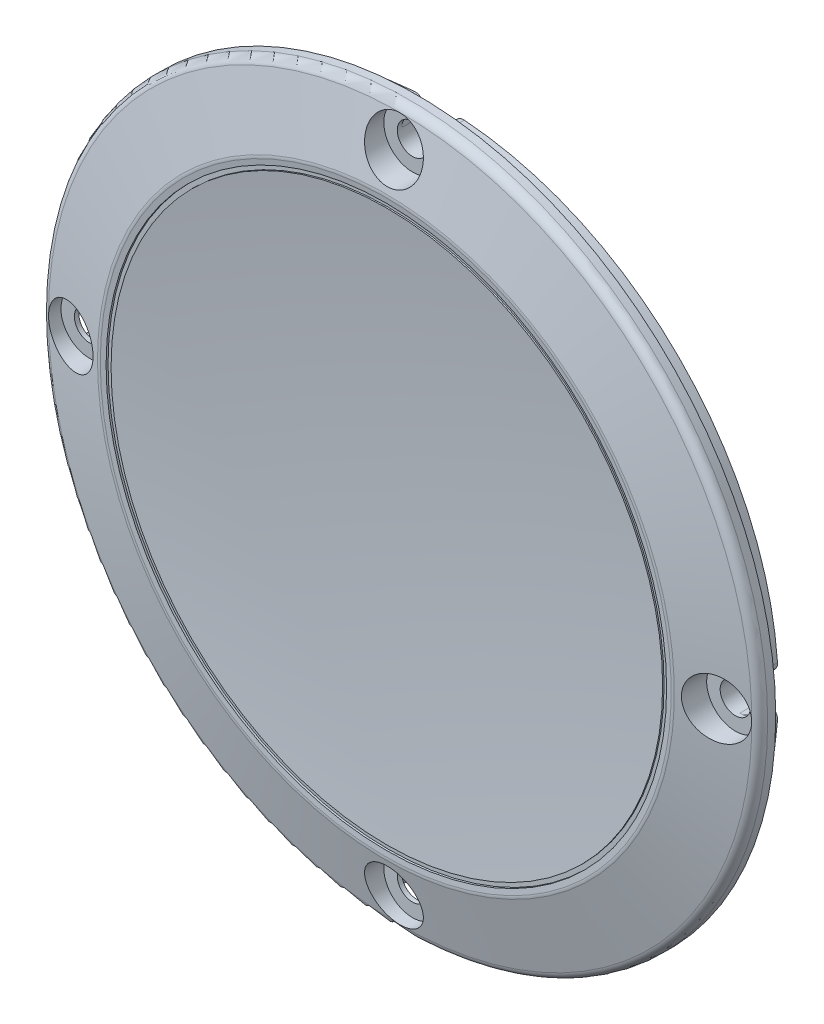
ISO-10303-21;
HEADER;
FILE_DESCRIPTION(('STEP AP214'),'2;1');
FILE_NAME('part.step','',(''),(''),'','','');
FILE_SCHEMA(('AUTOMOTIVE_DESIGN { 1 0 10303 214 1 1 1 1 }'));
ENDSEC;
DATA;
#1=APPLICATION_CONTEXT('core data for automotive mechanical design processes');
#2=APPLICATION_PROTOCOL_DEFINITION('international standard','automotive_design',2000,#1);
#3=PRODUCT_CONTEXT('',#1,'mechanical');
#4=PRODUCT('Part','Part','',(#3));
#5=PRODUCT_RELATED_PRODUCT_CATEGORY('part','',(#4));
#6=PRODUCT_DEFINITION_FORMATION('','',#4);
#7=PRODUCT_DEFINITION_CONTEXT('part definition',#1,'design');
#8=PRODUCT_DEFINITION('design','',#6,#7);
#9=PRODUCT_DEFINITION_SHAPE('','',#8);
#10=(LENGTH_UNIT() NAMED_UNIT(*) SI_UNIT(.MILLI.,.METRE.));
#11=(NAMED_UNIT(*) PLANE_ANGLE_UNIT() SI_UNIT($,.RADIAN.));
#12=(NAMED_UNIT(*) SI_UNIT($,.STERADIAN.) SOLID_ANGLE_UNIT());
#13=UNCERTAINTY_MEASURE_WITH_UNIT(LENGTH_MEASURE(1.E-05),#10,'distance_accuracy_value','');
#14=(GEOMETRIC_REPRESENTATION_CONTEXT(3) GLOBAL_UNCERTAINTY_ASSIGNED_CONTEXT((#13)) GLOBAL_UNIT_ASSIGNED_CONTEXT((#10,
#11,#12)) REPRESENTATION_CONTEXT('',''));
#15=CARTESIAN_POINT('',(0.,0.,0.));
#16=DIRECTION('',(0.,0.,1.));
#17=DIRECTION('',(1.,0.,0.));
#18=AXIS2_PLACEMENT_3D('',#15,#16,#17);
#19=CARTESIAN_POINT('',(0.,0.,23.));
#20=DIRECTION('',(0.,0.,-1.));
#21=DIRECTION('',(-1.,0.,0.));
#22=AXIS2_PLACEMENT_3D('',#19,#20,#21);
#23=CONICAL_SURFACE('',#22,31.9999999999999,1.34948188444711);
#24=CARTESIAN_POINT('',(-2.31153173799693,33.78712252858,22.5801262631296));
#25=CARTESIAN_POINT('',(-2.43838012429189,33.9196381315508,22.5484315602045));
#26=CARTESIAN_POINT('',(-2.55363306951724,34.0629068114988,22.5143651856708));
#27=CARTESIAN_POINT('',(-2.75778674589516,34.3665442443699,22.4426979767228));
#28=CARTESIAN_POINT('',(-2.84664684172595,34.526938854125,22.4050918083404));
#29=CARTESIAN_POINT('',(-2.99553437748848,34.8598411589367,22.3276421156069));
#30=CARTESIAN_POINT('',(-3.05559893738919,35.0323329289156,22.2878015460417));
#31=CARTESIAN_POINT('',(-3.14554800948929,35.3847025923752,22.2070486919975));
#32=CARTESIAN_POINT('',(-3.17544118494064,35.5645783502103,22.1661367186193));
#33=CARTESIAN_POINT('',(-3.20449467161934,35.9290391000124,22.0838765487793));
#34=CARTESIAN_POINT('',(-3.20327389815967,36.1136547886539,22.04252915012));
#35=CARTESIAN_POINT('',(-3.16911289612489,36.4802193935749,21.9610400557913));
#36=CARTESIAN_POINT('',(-3.13617008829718,36.6621680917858,21.9208984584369));
#37=CARTESIAN_POINT('',(-3.0392955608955,37.0181961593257,21.8428923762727));
#38=CARTESIAN_POINT('',(-2.97535626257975,37.1922735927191,21.8050284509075));
#39=CARTESIAN_POINT('',(-2.81806111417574,37.5273431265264,21.7325990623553));
#40=CARTESIAN_POINT('',(-2.72470715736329,37.6883360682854,21.6980333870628));
#41=CARTESIAN_POINT('',(-2.51254755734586,37.9901377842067,21.6335843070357));
#42=CARTESIAN_POINT('',(-2.39411974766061,38.1311993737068,21.6036417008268));
#43=CARTESIAN_POINT('',(-2.13425700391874,38.3913888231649,21.548655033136));
#44=CARTESIAN_POINT('',(-1.99282481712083,38.5105192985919,21.5236103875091));
#45=CARTESIAN_POINT('',(-1.69420320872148,38.7207176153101,21.4795704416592));
#46=CARTESIAN_POINT('',(-1.53741460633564,38.81233022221,21.4604574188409));
#47=CARTESIAN_POINT('',(-1.21011345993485,38.967902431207,21.4280750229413));
#48=CARTESIAN_POINT('',(-1.03960254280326,39.0318653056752,21.4148049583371));
#49=CARTESIAN_POINT('',(-0.693305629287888,39.1290633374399,21.3946643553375));
#50=CARTESIAN_POINT('',(-0.517688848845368,39.1628769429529,21.3876733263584));
#51=CARTESIAN_POINT('',(-0.163146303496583,39.2008062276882,21.3798325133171));
#52=CARTESIAN_POINT('',(0.0157792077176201,39.2049241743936,21.3789822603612));
#53=CARTESIAN_POINT('',(0.369839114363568,39.1834482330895,21.3834205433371));
#54=CARTESIAN_POINT('',(0.544993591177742,39.1581700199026,21.3886438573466));
#55=CARTESIAN_POINT('',(0.888490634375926,39.0792271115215,21.4049872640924));
#56=CARTESIAN_POINT('',(1.05683326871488,39.0255626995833,21.4161072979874));
#57=CARTESIAN_POINT('',(1.38231490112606,38.8914091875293,21.4439860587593));
#58=CARTESIAN_POINT('',(1.53943303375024,38.8108716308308,21.4607549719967));
#59=CARTESIAN_POINT('',(1.83787047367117,38.6254709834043,21.4995048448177));
#60=CARTESIAN_POINT('',(1.97918894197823,38.5206066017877,21.5214860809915));
#61=CARTESIAN_POINT('',(2.24410375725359,38.2881150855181,21.5704469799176));
#62=CARTESIAN_POINT('',(2.36743666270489,38.1602012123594,21.597489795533));
#63=CARTESIAN_POINT('',(2.59093209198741,37.8863503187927,21.6557040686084));
#64=CARTESIAN_POINT('',(2.6910923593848,37.740411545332,21.6868759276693));
#65=CARTESIAN_POINT('',(2.86759377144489,37.4314997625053,21.7532645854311));
#66=CARTESIAN_POINT('',(2.94340542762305,37.2682392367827,21.7885511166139));
#67=CARTESIAN_POINT('',(3.0665478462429,36.9318656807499,21.8617514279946));
#68=CARTESIAN_POINT('',(3.11387543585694,36.7587515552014,21.8996655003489));
#69=CARTESIAN_POINT('',(3.1796439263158,36.4038433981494,21.9779582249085));
#70=CARTESIAN_POINT('',(3.19747855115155,36.2219444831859,22.0183712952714));
#71=CARTESIAN_POINT('',(3.20202333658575,35.8579028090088,22.0998693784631));
#72=CARTESIAN_POINT('',(3.18873077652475,35.675760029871,22.1409544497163));
#73=CARTESIAN_POINT('',(3.13105126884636,35.3141114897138,22.2231556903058));
#74=CARTESIAN_POINT('',(3.08629426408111,35.134663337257,22.2642663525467));
#75=CARTESIAN_POINT('',(2.96643127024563,34.7857901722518,22.3447961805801));
#76=CARTESIAN_POINT('',(2.89132480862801,34.6163653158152,22.3842153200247));
#77=CARTESIAN_POINT('',(2.71294201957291,34.2929723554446,22.4599924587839));
#78=CARTESIAN_POINT('',(2.60975010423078,34.1389597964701,22.4963592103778));
#79=CARTESIAN_POINT('',(2.37778543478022,33.8504929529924,22.5649084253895));
#80=CARTESIAN_POINT('',(2.24901491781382,33.7160369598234,22.5970912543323));
#81=CARTESIAN_POINT('',(1.97207835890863,33.473309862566,22.6555017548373));
#82=CARTESIAN_POINT('',(1.82432832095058,33.3645889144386,22.681831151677));
#83=CARTESIAN_POINT('',(1.51170973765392,33.1736485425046,22.7282605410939));
#84=CARTESIAN_POINT('',(1.34684404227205,33.0914247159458,22.7483615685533));
#85=CARTESIAN_POINT('',(1.00954553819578,32.9581590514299,22.7810276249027));
#86=CARTESIAN_POINT('',(0.837445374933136,32.9063220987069,22.7937846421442));
#87=CARTESIAN_POINT('',(0.486642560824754,32.8321452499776,22.8120601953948));
#88=CARTESIAN_POINT('',(0.307941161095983,32.8097997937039,22.8175800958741));
#89=CARTESIAN_POINT('',(-0.0468446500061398,32.7955271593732,22.8211044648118));
#90=CARTESIAN_POINT('',(-0.222901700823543,32.8029504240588,22.8192694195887));
#91=CARTESIAN_POINT('',(-0.571246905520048,32.846511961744,22.8085208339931));
#92=CARTESIAN_POINT('',(-0.743534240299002,32.8826564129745,22.799605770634));
#93=CARTESIAN_POINT('',(-1.07891239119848,32.9823058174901,22.7751058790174));
#94=CARTESIAN_POINT('',(-1.24202889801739,33.0457295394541,22.7595408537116));
#95=CARTESIAN_POINT('',(-1.55507958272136,33.1978667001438,22.7223689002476));
#96=CARTESIAN_POINT('',(-1.70502882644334,33.2865507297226,22.7007689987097));
#97=CARTESIAN_POINT('',(-1.93037351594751,33.4457396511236,22.6622068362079));
#98=CARTESIAN_POINT('',(-2.01129836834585,33.5089814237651,22.6469282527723));
#99=CARTESIAN_POINT('',(-2.16652673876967,33.6427428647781,22.6147207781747));
#100=CARTESIAN_POINT('',(-2.24083036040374,33.7132624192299,22.5977919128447));
#101=CARTESIAN_POINT('',(-2.31153173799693,33.78712252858,22.5801262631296));
#102=B_SPLINE_CURVE_WITH_KNOTS('',3,(#24,#25,#26,#27,#28,#29,#30,#31,#32,#33,#34,#35,#36,#37,
#38,#39,#40,#41,#42,#43,#44,#45,#46,#47,#48,#49,#50,#51,#52,#53,#54,#55,#56,#57,#58,#59,#60,#61,
#62,#63,#64,#65,#66,#67,#68,#69,#70,#71,#72,#73,#74,#75,#76,#77,#78,#79,#80,#81,#82,#83,#84,#85,
#86,#87,#88,#89,#90,#91,#92,#93,#94,#95,#96,#97,#98,#99,#100,#101),.UNSPECIFIED.,.T.,.F.,(4,2,2,
2,2,2,2,2,2,2,2,2,2,2,2,2,2,2,2,2,2,2,2,2,2,2,2,2,2,2,2,2,2,2,2,2,2,2,4),(0.,0.558091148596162,
1.11703715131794,1.67526067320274,2.23332386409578,2.79822547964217,3.36317303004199,
3.92825878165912,4.49330816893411,5.05038221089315,5.6073897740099,6.15250690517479,
6.69755950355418,7.23191445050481,7.76622859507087,8.29485750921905,8.82348114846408,
9.3530631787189,9.88267331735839,10.4193947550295,10.9561684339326,11.5039287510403,
12.0517500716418,12.610698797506,13.1696963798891,13.7353808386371,14.3010741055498,
14.8650855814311,15.4290477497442,15.9822713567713,16.5354029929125,17.073327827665,
17.6111512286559,18.1373038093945,18.6635696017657,19.1882790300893,19.7123800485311,
20.0234477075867,20.3345104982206),.UNSPECIFIED.);
#103=CARTESIAN_POINT('',(-2.31153173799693,33.78712252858,22.5801262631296));
#104=VERTEX_POINT('',#103);
#105=EDGE_CURVE('E861',#104,#104,#102,.T.);
#106=ORIENTED_EDGE('',*,*,#105,.T.);
#107=EDGE_LOOP('',(#106));
#108=FACE_BOUND('',#107,.T.);
#109=CARTESIAN_POINT('',(-2.32300844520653,-38.2008252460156,21.5889368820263));
#110=CARTESIAN_POINT('',(-2.44861634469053,-38.0682311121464,21.6170000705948));
#111=CARTESIAN_POINT('',(-2.5626990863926,-37.925010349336,21.6474498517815));
#112=CARTESIAN_POINT('',(-2.76463662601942,-37.6217479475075,21.7123192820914));
#113=CARTESIAN_POINT('',(-2.85245251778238,-37.4616818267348,21.7467447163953));
#114=CARTESIAN_POINT('',(-2.99941395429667,-37.1297770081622,21.8186084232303));
#115=CARTESIAN_POINT('',(-3.05859748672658,-36.9579542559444,21.8560426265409));
#116=CARTESIAN_POINT('',(-3.14704579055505,-36.6072906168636,21.9329900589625));
#117=CARTESIAN_POINT('',(-3.17631832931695,-36.428451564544,21.9725027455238));
#118=CARTESIAN_POINT('',(-3.20454595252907,-36.0660960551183,22.0531620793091));
#119=CARTESIAN_POINT('',(-3.20306835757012,-35.8825491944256,22.0943238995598));
#120=CARTESIAN_POINT('',(-3.16883129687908,-35.5183725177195,22.1766240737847));
#121=CARTESIAN_POINT('',(-3.13606811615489,-35.3377430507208,22.2177624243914));
#122=CARTESIAN_POINT('',(-3.03971871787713,-34.98307291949,22.2991538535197));
#123=CARTESIAN_POINT('',(-2.97589190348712,-34.8090953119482,22.3393974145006));
#124=CARTESIAN_POINT('',(-2.81893244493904,-34.4742871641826,22.4174105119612));
#125=CARTESIAN_POINT('',(-2.72580028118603,-34.3134564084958,22.4551800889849));
#126=CARTESIAN_POINT('',(-2.51351940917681,-34.0110121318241,22.5266820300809));
#127=CARTESIAN_POINT('',(-2.39459056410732,-33.8692516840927,22.5604449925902));
#128=CARTESIAN_POINT('',(-2.13343748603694,-33.6078109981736,22.6230709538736));
#129=CARTESIAN_POINT('',(-1.99121613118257,-33.4881280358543,22.6519345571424));
#130=CARTESIAN_POINT('',(-1.69095065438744,-33.2772119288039,22.7030354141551));
#131=CARTESIAN_POINT('',(-1.53334375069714,-33.185389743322,22.7254093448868));
#132=CARTESIAN_POINT('',(-1.20416326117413,-33.0296249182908,22.7634855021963));
#133=CARTESIAN_POINT('',(-1.03259209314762,-32.9656774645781,22.7791888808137));
#134=CARTESIAN_POINT('',(-0.685404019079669,-32.8692180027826,22.8029169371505));
#135=CARTESIAN_POINT('',(-0.510025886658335,-32.8358945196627,22.8111397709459));
#136=CARTESIAN_POINT('',(-0.155989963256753,-32.7988542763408,22.8202814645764));
#137=CARTESIAN_POINT('',(0.0226674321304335,-32.7951339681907,22.8212011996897));
#138=CARTESIAN_POINT('',(0.374989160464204,-32.8172312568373,22.815745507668));
#139=CARTESIAN_POINT('',(0.548686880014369,-32.8425515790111,22.8094928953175));
#140=CARTESIAN_POINT('',(0.889254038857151,-32.9210772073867,22.7901539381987));
#141=CARTESIAN_POINT('',(1.05612352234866,-32.9742823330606,22.7770676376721));
#142=CARTESIAN_POINT('',(1.37894580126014,-33.1070659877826,22.7445376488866));
#143=CARTESIAN_POINT('',(1.53486314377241,-33.1867257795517,22.7250743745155));
#144=CARTESIAN_POINT('',(1.83109420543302,-33.3698992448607,22.6805467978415));
#145=CARTESIAN_POINT('',(1.97140651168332,-33.4734150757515,22.6554819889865));
#146=CARTESIAN_POINT('',(2.23562117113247,-33.7036261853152,22.6000724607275));
#147=CARTESIAN_POINT('',(2.35912156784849,-33.8307587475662,22.5696287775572));
#148=CARTESIAN_POINT('',(2.58312712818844,-34.1030172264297,22.5048752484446));
#149=CARTESIAN_POINT('',(2.68362916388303,-34.248145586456,22.4705648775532));
#150=CARTESIAN_POINT('',(2.86162903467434,-34.5565244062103,22.3981877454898));
#151=CARTESIAN_POINT('',(2.93842998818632,-34.7201592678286,22.3600444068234));
#152=CARTESIAN_POINT('',(3.06338397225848,-35.0576280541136,22.2819839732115));
#153=CARTESIAN_POINT('',(3.11153356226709,-35.2314632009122,22.2420666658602));
#154=CARTESIAN_POINT('',(3.17868380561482,-35.5882069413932,22.160777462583));
#155=CARTESIAN_POINT('',(3.19707162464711,-35.7712281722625,22.1193924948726));
#156=CARTESIAN_POINT('',(3.20228236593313,-36.1378405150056,22.0371254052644));
#157=CARTESIAN_POINT('',(3.18910358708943,-36.321431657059,21.9962433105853));
#158=CARTESIAN_POINT('',(3.13127113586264,-36.684979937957,21.915872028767));
#159=CARTESIAN_POINT('',(3.08644819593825,-36.8649121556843,21.8763915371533));
#160=CARTESIAN_POINT('',(2.96620041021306,-37.21485822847,21.8001182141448));
#161=CARTESIAN_POINT('',(2.89077667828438,-37.3848724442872,21.76332528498));
#162=CARTESIAN_POINT('',(2.71216212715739,-37.7081972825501,21.693768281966));
#163=CARTESIAN_POINT('',(2.60926287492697,-37.8616608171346,21.6609668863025));
#164=CARTESIAN_POINT('',(2.37807580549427,-38.1491312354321,21.599830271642));
#165=CARTESIAN_POINT('',(2.24979060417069,-38.2831401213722,21.5714945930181));
#166=CARTESIAN_POINT('',(1.9742053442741,-38.5249646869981,21.5205683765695));
#167=CARTESIAN_POINT('',(1.8273381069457,-38.6332516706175,21.4978740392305));
#168=CARTESIAN_POINT('',(1.51678579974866,-38.82356382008,21.4581073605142));
#169=CARTESIAN_POINT('',(1.35310279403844,-38.9055922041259,21.4410343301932));
#170=CARTESIAN_POINT('',(1.01728396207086,-39.0392611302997,21.4132658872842));
#171=CARTESIAN_POINT('',(0.845398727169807,-39.0915052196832,21.4024437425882));
#172=CARTESIAN_POINT('',(0.495059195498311,-39.1665434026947,21.3869124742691));
#173=CARTESIAN_POINT('',(0.31660578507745,-39.189341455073,21.3822025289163));
#174=CARTESIAN_POINT('',(-0.0391143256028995,-39.2046404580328,21.3790410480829));
#175=CARTESIAN_POINT('',(-0.216362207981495,-39.1975646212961,21.3805020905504));
#176=CARTESIAN_POINT('',(-0.567156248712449,-39.1542932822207,21.3894484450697));
#177=CARTESIAN_POINT('',(-0.740701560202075,-39.1180911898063,21.3969351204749));
#178=CARTESIAN_POINT('',(-1.07882705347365,-39.0178126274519,21.4177204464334));
#179=CARTESIAN_POINT('',(-1.24342184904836,-38.9537832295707,21.4310092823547));
#180=CARTESIAN_POINT('',(-1.55929640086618,-38.7998912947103,21.4630520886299));
#181=CARTESIAN_POINT('',(-1.71059189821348,-38.7100598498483,21.4817994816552));
#182=CARTESIAN_POINT('',(-1.93808716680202,-38.5484679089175,21.5156621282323));
#183=CARTESIAN_POINT('',(-2.01989506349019,-38.4841110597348,21.5291759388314));
#184=CARTESIAN_POINT('',(-2.17670902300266,-38.3479189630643,21.557849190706));
#185=CARTESIAN_POINT('',(-2.25171517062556,-38.2760838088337,21.5730086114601));
#186=CARTESIAN_POINT('',(-2.32300844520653,-38.2008252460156,21.5889368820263));
#187=B_SPLINE_CURVE_WITH_KNOTS('',3,(#109,#110,#111,#112,#113,#114,#115,#116,#117,#118,#119,
#120,#121,#122,#123,#124,#125,#126,#127,#128,#129,#130,#131,#132,#133,#134,#135,#136,#137,#138,
#139,#140,#141,#142,#143,#144,#145,#146,#147,#148,#149,#150,#151,#152,#153,#154,#155,#156,#157,
#158,#159,#160,#161,#162,#163,#164,#165,#166,#167,#168,#169,#170,#171,#172,#173,#174,#175,#176,
#177,#178,#179,#180,#181,#182,#183,#184,#185,#186),.UNSPECIFIED.,.T.,.F.,(4,2,2,2,2,2,2,2,2,2,2,
2,2,2,2,2,2,2,2,2,2,2,2,2,2,2,2,2,2,2,2,2,2,2,2,2,2,2,4),(0.,0.553967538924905,1.10875159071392,
1.6627975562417,2.21669960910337,2.7784007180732,3.34016853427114,3.90635836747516,
4.47253891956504,5.03407133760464,5.59553442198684,6.14413259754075,6.69263598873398,
7.22614665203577,7.75959337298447,8.28404032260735,8.80848387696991,9.33455353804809,
9.86067079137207,10.3977295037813,10.9348612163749,11.4865427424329,12.0382905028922,
12.601261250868,13.1642623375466,13.7302980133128,14.2963130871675,14.8565452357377,
15.4167196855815,15.965662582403,16.5145381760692,17.0518552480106,17.5891000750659,
18.1187596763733,18.6485391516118,19.1774259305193,19.7056780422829,20.0201061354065,
20.3345303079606),.UNSPECIFIED.);
#188=CARTESIAN_POINT('',(-2.32300844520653,-38.2008252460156,21.5889368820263));
#189=VERTEX_POINT('',#188);
#190=EDGE_CURVE('E673',#189,#189,#187,.T.);
#191=ORIENTED_EDGE('',*,*,#190,.T.);
#192=EDGE_LOOP('',(#191));
#193=FACE_BOUND('',#192,.T.);
#194=CARTESIAN_POINT('',(0.,0.,22.963064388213));
#195=DIRECTION('',(0.,0.,-1.));
#196=DIRECTION('',(-1.,0.,0.));
#197=AXIS2_PLACEMENT_3D('',#194,#195,#196);
#198=CIRCLE('',#197,32.1641582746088);
#199=CARTESIAN_POINT('',(-32.1641582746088,0.,22.963064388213));
#200=VERTEX_POINT('',#199);
#201=EDGE_CURVE('E451',#200,#200,#198,.T.);
#202=ORIENTED_EDGE('',*,*,#201,.T.);
#203=EDGE_LOOP('',(#202));
#204=FACE_BOUND('',#203,.T.);
#205=CARTESIAN_POINT('',(0.,0.,21.3756097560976));
#206=DIRECTION('',(0.,0.,-1.));
#207=DIRECTION('',(-1.,0.,0.));
#208=AXIS2_PLACEMENT_3D('',#205,#206,#207);
#209=CIRCLE('',#208,39.2195121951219);
#210=CARTESIAN_POINT('',(-39.2195121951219,0.,21.3756097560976));
#211=VERTEX_POINT('',#210);
#212=EDGE_CURVE('E447',#211,#211,#209,.F.);
#213=ORIENTED_EDGE('',*,*,#212,.T.);
#214=EDGE_LOOP('',(#213));
#215=FACE_BOUND('',#214,.T.);
#216=CARTESIAN_POINT('',(33.78712252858,-2.31153173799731,22.5801262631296));
#217=CARTESIAN_POINT('',(33.6595205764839,-2.18936685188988,22.6106456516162));
#218=CARTESIAN_POINT('',(33.5417075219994,-2.05627943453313,22.6390090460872));
#219=CARTESIAN_POINT('',(33.3292712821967,-1.7716627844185,22.6903892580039));
#220=CARTESIAN_POINT('',(33.234668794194,-1.62011727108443,22.7134013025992));
#221=CARTESIAN_POINT('',(33.0716824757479,-1.30261503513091,22.7531831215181));
#222=CARTESIAN_POINT('',(33.00331553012,-1.13664911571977,22.7699488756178));
#223=CARTESIAN_POINT('',(32.8951961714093,-0.795148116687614,22.7965164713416));
#224=CARTESIAN_POINT('',(32.8554361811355,-0.619615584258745,22.806320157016));
#225=CARTESIAN_POINT('',(32.8063001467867,-0.267189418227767,22.8184418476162));
#226=CARTESIAN_POINT('',(32.7964120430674,-0.0903714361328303,22.820886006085));
#227=CARTESIAN_POINT('',(32.8059010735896,0.262425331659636,22.8185427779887));
#228=CARTESIAN_POINT('',(32.825277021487,0.438404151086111,22.8137556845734));
#229=CARTESIAN_POINT('',(32.8923146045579,0.782803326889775,22.7972334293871));
#230=CARTESIAN_POINT('',(32.9397071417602,0.951279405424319,22.785564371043));
#231=CARTESIAN_POINT('',(33.0610178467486,1.27777854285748,22.7558056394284));
#232=CARTESIAN_POINT('',(33.1349369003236,1.43580125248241,22.73771575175));
#233=CARTESIAN_POINT('',(33.307949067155,1.73886208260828,22.6955799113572));
#234=CARTESIAN_POINT('',(33.4073101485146,1.88373825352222,22.6714706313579));
#235=CARTESIAN_POINT('',(33.6277946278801,2.15480299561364,22.618284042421));
#236=CARTESIAN_POINT('',(33.7489205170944,2.28098942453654,22.5892061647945));
#237=CARTESIAN_POINT('',(34.0127279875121,2.51446625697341,22.5262912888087));
#238=CARTESIAN_POINT('',(34.1558712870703,2.62120778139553,22.4923537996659));
#239=CARTESIAN_POINT('',(34.4573184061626,2.80921724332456,22.4214022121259));
#240=CARTESIAN_POINT('',(34.6156243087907,2.89048167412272,22.3843876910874));
#241=CARTESIAN_POINT('',(34.9473240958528,3.02735578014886,22.307413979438));
#242=CARTESIAN_POINT('',(35.1210020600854,3.08224867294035,22.2674034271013));
#243=CARTESIAN_POINT('',(35.4749500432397,3.1618404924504,22.1864970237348));
#244=CARTESIAN_POINT('',(35.6552207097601,3.18653644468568,22.1456010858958));
#245=CARTESIAN_POINT('',(36.0201330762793,3.20522482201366,22.0634468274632));
#246=CARTESIAN_POINT('',(36.2047997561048,3.19875038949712,22.0221922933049));
#247=CARTESIAN_POINT('',(36.5705834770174,3.15410572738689,21.9410761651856));
#248=CARTESIAN_POINT('',(36.7517004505,3.11593489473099,21.9012145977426));
#249=CARTESIAN_POINT('',(37.1049514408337,3.0088380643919,21.8239962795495));
#250=CARTESIAN_POINT('',(37.2770951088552,2.93994590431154,21.7866368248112));
#251=CARTESIAN_POINT('',(37.6074799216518,2.77312917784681,21.7153706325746));
#252=CARTESIAN_POINT('',(37.7657220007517,2.67520656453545,21.6814636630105));
#253=CARTESIAN_POINT('',(38.0611701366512,2.45459892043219,21.6184882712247));
#254=CARTESIAN_POINT('',(38.1986567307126,2.3323083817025,21.5893547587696));
#255=CARTESIAN_POINT('',(38.4510897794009,2.06540209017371,21.5360901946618));
#256=CARTESIAN_POINT('',(38.566038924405,1.92078900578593,21.5119585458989));
#257=CARTESIAN_POINT('',(38.7674669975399,1.61668610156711,21.4698079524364));
#258=CARTESIAN_POINT('',(38.8545058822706,1.45758386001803,21.4516685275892));
#259=CARTESIAN_POINT('',(39.0006220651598,1.12649754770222,21.4212814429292));
#260=CARTESIAN_POINT('',(39.059702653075,0.954514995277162,21.4090330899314));
#261=CARTESIAN_POINT('',(39.1471091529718,0.60609354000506,21.3909311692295));
#262=CARTESIAN_POINT('',(39.1760013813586,0.429802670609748,21.3849598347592));
#263=CARTESIAN_POINT('',(39.2040770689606,0.0747753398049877,21.3791570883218));
#264=CARTESIAN_POINT('',(39.2032626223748,-0.103960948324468,21.3793252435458));
#265=CARTESIAN_POINT('',(39.172108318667,-0.456974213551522,21.3857646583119));
#266=CARTESIAN_POINT('',(39.1420544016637,-0.63127761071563,21.3919768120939));
#267=CARTESIAN_POINT('',(39.0537998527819,-0.972277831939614,21.4102569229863));
#268=CARTESIAN_POINT('',(38.9955993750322,-1.13897469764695,21.4223248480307));
#269=CARTESIAN_POINT('',(38.8526650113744,-1.46060294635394,21.4520525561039));
#270=CARTESIAN_POINT('',(38.7678556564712,-1.61549928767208,21.4697282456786));
#271=CARTESIAN_POINT('',(38.5743533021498,-1.90881673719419,21.5102171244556));
#272=CARTESIAN_POINT('',(38.4656588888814,-2.04723686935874,21.5330306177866));
#273=CARTESIAN_POINT('',(38.2259054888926,-2.30583444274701,21.5835928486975));
#274=CARTESIAN_POINT('',(38.0945503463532,-2.42572435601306,21.6114071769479));
#275=CARTESIAN_POINT('',(37.8144264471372,-2.6418096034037,21.6710567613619));
#276=CARTESIAN_POINT('',(37.6656559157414,-2.73800251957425,21.702892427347));
#277=CARTESIAN_POINT('',(37.3516572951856,-2.90609477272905,21.7705067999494));
#278=CARTESIAN_POINT('',(37.1861515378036,-2.97744797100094,21.8063536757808));
#279=CARTESIAN_POINT('',(36.8460412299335,-3.09134042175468,21.8805291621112));
#280=CARTESIAN_POINT('',(36.6714360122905,-3.1338775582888,21.9188579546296));
#281=CARTESIAN_POINT('',(36.314393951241,-3.18974100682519,21.9978080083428));
#282=CARTESIAN_POINT('',(36.1318704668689,-3.20247135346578,22.0384596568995));
#283=CARTESIAN_POINT('',(35.7673709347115,-3.19673544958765,22.1202636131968));
#284=CARTESIAN_POINT('',(35.5853950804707,-3.17825923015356,22.1614160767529));
#285=CARTESIAN_POINT('',(35.2250529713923,-3.11021997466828,22.243529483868));
#286=CARTESIAN_POINT('',(35.0467514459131,-3.06030522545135,22.2844829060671));
#287=CARTESIAN_POINT('',(34.7011726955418,-2.93036706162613,22.3644546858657));
#288=CARTESIAN_POINT('',(34.5338831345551,-2.85037803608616,22.4034751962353));
#289=CARTESIAN_POINT('',(34.2687865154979,-2.69407018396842,22.4657419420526));
#290=CARTESIAN_POINT('',(34.1665160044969,-2.6255443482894,22.4898839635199));
#291=CARTESIAN_POINT('',(33.9702772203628,-2.47696811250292,22.5364104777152));
#292=CARTESIAN_POINT('',(33.8763088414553,-2.39691785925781,22.5587949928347));
#293=CARTESIAN_POINT('',(33.78712252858,-2.31153173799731,22.5801262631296));
#294=B_SPLINE_CURVE_WITH_KNOTS('',3,(#216,#217,#218,#219,#220,#221,#222,#223,#224,#225,#226,
#227,#228,#229,#230,#231,#232,#233,#234,#235,#236,#237,#238,#239,#240,#241,#242,#243,#244,#245,
#246,#247,#248,#249,#250,#251,#252,#253,#254,#255,#256,#257,#258,#259,#260,#261,#262,#263,#264,
#265,#266,#267,#268,#269,#270,#271,#272,#273,#274,#275,#276,#277,#278,#279,#280,#281,#282,#283,
#284,#285,#286,#287,#288,#289,#290,#291,#292,#293),.UNSPECIFIED.,.T.,.F.,(4,2,2,2,2,2,2,2,2,2,2,
2,2,2,2,2,2,2,2,2,2,2,2,2,2,2,2,2,2,2,2,2,2,2,2,2,2,2,4),(0.,0.537370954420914,1.07521936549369,
1.61341334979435,2.15146472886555,2.68023903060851,3.20899189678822,3.73274679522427,
4.25651918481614,4.78605301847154,5.31564750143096,5.85843164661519,6.4012904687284,
6.95816954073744,7.51510346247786,8.08040464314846,8.64571657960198,9.21040739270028,
9.77506022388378,10.331222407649,10.8873181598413,11.4314346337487,11.9754870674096,
12.5091394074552,13.0427541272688,13.5712024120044,14.0996478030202,14.6296057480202,
15.1595950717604,15.6971238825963,16.2347075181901,16.7834579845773,17.332248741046,
17.8919218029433,18.4517736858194,19.0180028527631,19.5835865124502,19.9591822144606,
20.33477313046),.UNSPECIFIED.);
#295=CARTESIAN_POINT('',(33.78712252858,-2.31153173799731,22.5801262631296));
#296=VERTEX_POINT('',#295);
#297=EDGE_CURVE('E681',#296,#296,#294,.T.);
#298=ORIENTED_EDGE('',*,*,#297,.T.);
#299=EDGE_LOOP('',(#298));
#300=FACE_BOUND('',#299,.T.);
#301=CARTESIAN_POINT('',(-38.2008252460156,-2.32300844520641,21.5889368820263));
#302=CARTESIAN_POINT('',(-38.3293718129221,-2.20121336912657,21.5617304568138));
#303=CARTESIAN_POINT('',(-38.4481147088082,-2.06841301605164,21.536728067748));
#304=CARTESIAN_POINT('',(-38.6623284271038,-1.78429655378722,21.4917800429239));
#305=CARTESIAN_POINT('',(-38.7577770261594,-1.63296296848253,21.4718392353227));
#306=CARTESIAN_POINT('',(-38.9223614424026,-1.31593970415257,21.4375401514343));
#307=CARTESIAN_POINT('',(-38.9914894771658,-1.15024579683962,21.4231835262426));
#308=CARTESIAN_POINT('',(-39.1011449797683,-0.809296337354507,21.4004429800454));
#309=CARTESIAN_POINT('',(-39.1416792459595,-0.634043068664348,21.3920576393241));
#310=CARTESIAN_POINT('',(-39.1925543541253,-0.28110117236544,21.3815370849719));
#311=CARTESIAN_POINT('',(-39.2032393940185,-0.103464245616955,21.3793306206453));
#312=CARTESIAN_POINT('',(-39.1950575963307,0.251097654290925,21.3810212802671));
#313=CARTESIAN_POINT('',(-39.1761912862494,0.428022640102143,21.3849182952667));
#314=CARTESIAN_POINT('',(-39.1097160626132,0.775044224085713,21.3986727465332));
#315=CARTESIAN_POINT('',(-39.0622788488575,0.945175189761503,21.408494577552));
#316=CARTESIAN_POINT('',(-38.9403011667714,1.27496740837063,21.4338174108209));
#317=CARTESIAN_POINT('',(-38.8657603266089,1.43462851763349,21.449318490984));
#318=CARTESIAN_POINT('',(-38.6912865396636,1.74015202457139,21.485731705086));
#319=CARTESIAN_POINT('',(-38.5911879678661,1.88591555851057,21.5066791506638));
#320=CARTESIAN_POINT('',(-38.3688701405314,2.15856507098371,21.5534124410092));
#321=CARTESIAN_POINT('',(-38.2466492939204,2.28544969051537,21.579198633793));
#322=CARTESIAN_POINT('',(-37.9814200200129,2.51907302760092,21.6354522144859));
#323=CARTESIAN_POINT('',(-37.838095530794,2.62543553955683,21.6659912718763));
#324=CARTESIAN_POINT('',(-37.5363956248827,2.81265322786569,21.7306666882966));
#325=CARTESIAN_POINT('',(-37.3780185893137,2.89350565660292,21.7648034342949));
#326=CARTESIAN_POINT('',(-37.0471191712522,3.02922352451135,21.8365997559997));
#327=CARTESIAN_POINT('',(-36.8743669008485,3.08349698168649,21.8743190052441));
#328=CARTESIAN_POINT('',(-36.5226043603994,3.1621792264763,21.9516796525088));
#329=CARTESIAN_POINT('',(-36.3435934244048,3.18658482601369,21.9913212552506));
#330=CARTESIAN_POINT('',(-35.9809665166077,3.20518106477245,22.0722274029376));
#331=CARTESIAN_POINT('',(-35.7973256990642,3.19881916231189,22.1135083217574));
#332=CARTESIAN_POINT('',(-35.433772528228,3.15482467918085,22.1958637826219));
#333=CARTESIAN_POINT('',(-35.2538604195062,3.11719005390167,22.2369383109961));
#334=CARTESIAN_POINT('',(-34.9016340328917,3.01125189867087,22.317962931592));
#335=CARTESIAN_POINT('',(-34.7293790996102,2.94274348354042,22.3579035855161));
#336=CARTESIAN_POINT('',(-34.3987820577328,2.77674440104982,22.4351141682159));
#337=CARTESIAN_POINT('',(-34.2404396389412,2.67925438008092,22.4723841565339));
#338=CARTESIAN_POINT('',(-33.9438677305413,2.45888661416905,22.5426491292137));
#339=CARTESIAN_POINT('',(-33.805461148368,2.33625934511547,22.5756814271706));
#340=CARTESIAN_POINT('',(-33.5513132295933,2.06833550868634,22.6366760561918));
#341=CARTESIAN_POINT('',(-33.4355689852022,1.92304185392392,22.6646390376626));
#342=CARTESIAN_POINT('',(-33.2329989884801,1.61755862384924,22.7137944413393));
#343=CARTESIAN_POINT('',(-33.145552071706,1.45780444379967,22.7351318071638));
#344=CARTESIAN_POINT('',(-32.9988195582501,1.12514278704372,22.7710416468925));
#345=CARTESIAN_POINT('',(-32.9395290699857,0.952237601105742,22.7856152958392));
#346=CARTESIAN_POINT('',(-32.8523651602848,0.603219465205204,22.8070720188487));
#347=CARTESIAN_POINT('',(-32.8236852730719,0.427319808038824,22.8141524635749));
#348=CARTESIAN_POINT('',(-32.7959061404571,0.073066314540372,22.821010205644));
#349=CARTESIAN_POINT('',(-32.7968036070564,-0.105287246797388,22.820788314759));
#350=CARTESIAN_POINT('',(-32.8278961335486,-0.4564546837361,22.8131133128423));
#351=CARTESIAN_POINT('',(-32.8576362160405,-0.629311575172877,22.8057724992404));
#352=CARTESIAN_POINT('',(-32.9447587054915,-0.967463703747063,22.7843301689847));
#353=CARTESIAN_POINT('',(-33.0021411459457,-1.1327589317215,22.7702286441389));
#354=CARTESIAN_POINT('',(-33.1430413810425,-1.45202598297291,22.7357463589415));
#355=CARTESIAN_POINT('',(-33.2266811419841,-1.60594073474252,22.7153363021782));
#356=CARTESIAN_POINT('',(-33.4174234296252,-1.89754098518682,22.6690344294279));
#357=CARTESIAN_POINT('',(-33.5245282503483,-2.03522489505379,22.6431420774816));
#358=CARTESIAN_POINT('',(-33.7616245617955,-2.29370786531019,22.5861738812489));
#359=CARTESIAN_POINT('',(-33.892063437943,-2.41407421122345,22.5549974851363));
#360=CARTESIAN_POINT('',(-34.1703995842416,-2.63130016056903,22.4889302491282));
#361=CARTESIAN_POINT('',(-34.318299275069,-2.72815649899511,22.4540388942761));
#362=CARTESIAN_POINT('',(-34.6316782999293,-2.89833312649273,22.3806491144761));
#363=CARTESIAN_POINT('',(-34.7975246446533,-2.97094679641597,22.3420787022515));
#364=CARTESIAN_POINT('',(-35.1387205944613,-3.08718132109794,22.2633390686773));
#365=CARTESIAN_POINT('',(-35.3140709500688,-3.13079988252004,22.2231697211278));
#366=CARTESIAN_POINT('',(-35.6729402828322,-3.1885248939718,22.1415905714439));
#367=CARTESIAN_POINT('',(-35.8565515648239,-3.20204625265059,22.1001717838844));
#368=CARTESIAN_POINT('',(-36.2235874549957,-3.1974519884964,22.0180035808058));
#369=CARTESIAN_POINT('',(-36.4070119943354,-3.17932726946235,21.9772543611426));
#370=CARTESIAN_POINT('',(-36.7692361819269,-3.11165365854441,21.8973576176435));
#371=CARTESIAN_POINT('',(-36.9480108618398,-3.06196152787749,21.8582182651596));
#372=CARTESIAN_POINT('',(-37.2946745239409,-2.93223253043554,21.7828206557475));
#373=CARTESIAN_POINT('',(-37.4625765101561,-2.85223272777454,21.7465589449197));
#374=CARTESIAN_POINT('',(-37.7264427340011,-2.69703126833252,21.6899009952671));
#375=CARTESIAN_POINT('',(-37.8270253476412,-2.62994107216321,21.6683921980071));
#376=CARTESIAN_POINT('',(-38.020212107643,-2.48462283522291,21.6272235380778));
#377=CARTESIAN_POINT('',(-38.1128163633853,-2.40639494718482,21.6075636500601));
#378=CARTESIAN_POINT('',(-38.2008252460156,-2.32300844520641,21.5889368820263));
#379=B_SPLINE_CURVE_WITH_KNOTS('',3,(#301,#302,#303,#304,#305,#306,#307,#308,#309,#310,#311,
#312,#313,#314,#315,#316,#317,#318,#319,#320,#321,#322,#323,#324,#325,#326,#327,#328,#329,#330,
#331,#332,#333,#334,#335,#336,#337,#338,#339,#340,#341,#342,#343,#344,#345,#346,#347,#348,#349,
#350,#351,#352,#353,#354,#355,#356,#357,#358,#359,#360,#361,#362,#363,#364,#365,#366,#367,#368,
#369,#370,#371,#372,#373,#374,#375,#376,#377,#378),.UNSPECIFIED.,.T.,.F.,(4,2,2,2,2,2,2,2,2,2,2,
2,2,2,2,2,2,2,2,2,2,2,2,2,2,2,2,2,2,2,2,2,2,2,2,2,2,2,4),(0.,0.537044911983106,1.07460019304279,
1.61231429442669,2.14990050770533,2.68126159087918,3.21261318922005,3.74080299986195,
4.26900005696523,4.80071100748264,5.33246021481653,5.87318510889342,6.41396822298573,
6.96630266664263,7.51869606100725,8.08104612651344,8.64343296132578,9.20960816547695,
9.77577074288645,10.3365445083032,10.8972462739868,11.4446400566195,11.9919387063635,
12.5244325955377,13.056867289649,13.5810374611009,14.1052082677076,14.6318508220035,
15.1585448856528,15.6967022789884,16.2349343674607,16.7877087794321,17.340526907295,
17.9040013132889,18.4676377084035,19.0338500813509,19.5993722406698,19.9670628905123,
20.3347484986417),.UNSPECIFIED.);
#380=CARTESIAN_POINT('',(-38.2008252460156,-2.32300844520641,21.5889368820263));
#381=VERTEX_POINT('',#380);
#382=EDGE_CURVE('E628',#381,#381,#379,.T.);
#383=ORIENTED_EDGE('',*,*,#382,.T.);
#384=EDGE_LOOP('',(#383));
#385=FACE_BOUND('',#384,.T.);
#386=ADVANCED_FACE('F47',(#108,#193,#204,#215,#300,#385),#23,.T.);
#387=CARTESIAN_POINT('',(0.,0.,306.544444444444));
#388=DIRECTION('',(0.,0.,1.));
#389=DIRECTION('',(-1.,0.,0.));
#390=AXIS2_PLACEMENT_3D('',#387,#388,#389);
#391=SPHERICAL_SURFACE('',#390,285.344444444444);
#392=CARTESIAN_POINT('',(0.,0.,22.9812123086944));
#393=DIRECTION('',(0.,0.,1.));
#394=DIRECTION('',(1.,0.,0.));
#395=AXIS2_PLACEMENT_3D('',#392,#393,#394);
#396=CIRCLE('',#395,31.8330858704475);
#397=CARTESIAN_POINT('',(-31.8330858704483,0.,22.9812123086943));
#398=VERTEX_POINT('',#397);
#399=EDGE_CURVE('E444',#398,#398,#396,.T.);
#400=CARTESIAN_POINT('',(0.,0.,22.9163614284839));
#401=DIRECTION('',(0.,0.,1.));
#402=DIRECTION('',(1.,0.,0.));
#403=AXIS2_PLACEMENT_3D('',#400,#401,#402);
#404=CIRCLE('',#403,31.25);
#405=CARTESIAN_POINT('',(-31.2499999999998,0.,22.9163614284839));
#406=VERTEX_POINT('',#405);
#407=EDGE_CURVE('E554',#406,#406,#404,.T.);
#408=CARTESIAN_POINT('',(-31.8330858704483,0.,22.9812123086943));
#409=CARTESIAN_POINT('',(-31.8270127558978,0.,22.9805305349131));
#410=CARTESIAN_POINT('',(-31.8209396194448,0.,22.9798489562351));
#411=CARTESIAN_POINT('',(-31.8087933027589,0.,22.978486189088));
#412=CARTESIAN_POINT('',(-31.8027201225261,0.,22.9778050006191));
#413=CARTESIAN_POINT('',(-31.7905737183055,0.,22.9764430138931));
#414=CARTESIAN_POINT('',(-31.7845004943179,0.,22.9757622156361));
#415=CARTESIAN_POINT('',(-31.7723540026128,0.,22.9744010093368));
#416=CARTESIAN_POINT('',(-31.7662807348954,0.,22.9737206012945));
#417=CARTESIAN_POINT('',(-31.754134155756,0.,22.9723601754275));
#418=CARTESIAN_POINT('',(-31.7480608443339,0.,22.9716801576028));
#419=CARTESIAN_POINT('',(-31.7359141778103,0.,22.9703205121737));
#420=CARTESIAN_POINT('',(-31.7298408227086,0.,22.9696408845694));
#421=CARTESIAN_POINT('',(-31.7176940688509,0.,22.9682820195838));
#422=CARTESIAN_POINT('',(-31.7116206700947,0.,22.9676027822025));
#423=CARTESIAN_POINT('',(-31.699473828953,0.,22.9662446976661));
#424=CARTESIAN_POINT('',(-31.6934003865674,0.,22.9655658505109));
#425=CARTESIAN_POINT('',(-31.6812534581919,0.,22.9642085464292));
#426=CARTESIAN_POINT('',(-31.675179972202,0.,22.9635300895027));
#427=CARTESIAN_POINT('',(-31.6630329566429,0.,22.9621735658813));
#428=CARTESIAN_POINT('',(-31.6569594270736,0.,22.9614954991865));
#429=CARTESIAN_POINT('',(-31.6448123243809,0.,22.9601397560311));
#430=CARTESIAN_POINT('',(-31.6387387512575,0.,22.9594620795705));
#431=CARTESIAN_POINT('',(-31.6265915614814,0.,22.9581071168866));
#432=CARTESIAN_POINT('',(-31.6205179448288,0.,22.9574298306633));
#433=CARTESIAN_POINT('',(-31.6083706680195,0.,22.9560756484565));
#434=CARTESIAN_POINT('',(-31.6022970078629,0.,22.9553987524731));
#435=CARTESIAN_POINT('',(-31.5901496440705,0.,22.9540453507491));
#436=CARTESIAN_POINT('',(-31.5840759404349,0.,22.9533688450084));
#437=CARTESIAN_POINT('',(-31.5719284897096,0.,22.9520162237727));
#438=CARTESIAN_POINT('',(-31.56585474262,0.,22.9513401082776));
#439=CARTESIAN_POINT('',(-31.5537072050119,0.,22.9499882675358));
#440=CARTESIAN_POINT('',(-31.5476334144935,0.,22.949312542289));
#441=CARTESIAN_POINT('',(-31.5354857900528,0.,22.9479614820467));
#442=CARTESIAN_POINT('',(-31.5294119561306,0.,22.9472861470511));
#443=CARTESIAN_POINT('',(-31.5172642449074,0.,22.9459358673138));
#444=CARTESIAN_POINT('',(-31.5111903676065,0.,22.9452609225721));
#445=CARTESIAN_POINT('',(-31.499042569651,0.,22.9439114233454));
#446=CARTESIAN_POINT('',(-31.4929686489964,0.,22.9432368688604));
#447=CARTESIAN_POINT('',(-31.4808207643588,0.,22.9418881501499));
#448=CARTESIAN_POINT('',(-31.4747468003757,0.,22.9412139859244));
#449=CARTESIAN_POINT('',(-31.462598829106,0.,22.9398660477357));
#450=CARTESIAN_POINT('',(-31.4565248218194,0.,22.9391922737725));
#451=CARTESIAN_POINT('',(-31.4443767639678,0.,22.9378451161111));
#452=CARTESIAN_POINT('',(-31.4383027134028,0.,22.9371717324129));
#453=CARTESIAN_POINT('',(-31.4261545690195,0.,22.9358253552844));
#454=CARTESIAN_POINT('',(-31.4200804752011,0.,22.9351523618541));
#455=CARTESIAN_POINT('',(-31.4079322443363,0.,22.933806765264));
#456=CARTESIAN_POINT('',(-31.4018581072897,0.,22.9331341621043));
#457=CARTESIAN_POINT('',(-31.3897097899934,0.,22.9317893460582));
#458=CARTESIAN_POINT('',(-31.3836356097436,0.,22.9311171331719));
#459=CARTESIAN_POINT('',(-31.371487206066,0.,22.9297730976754));
#460=CARTESIAN_POINT('',(-31.3654129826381,0.,22.9291012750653));
#461=CARTESIAN_POINT('',(-31.3532644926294,0.,22.9277580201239));
#462=CARTESIAN_POINT('',(-31.3471902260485,0.,22.9270865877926));
#463=CARTESIAN_POINT('',(-31.3350416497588,0.,22.9257441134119));
#464=CARTESIAN_POINT('',(-31.3289673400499,0.,22.9250730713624));
#465=CARTESIAN_POINT('',(-31.3168186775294,0.,22.9237313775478));
#466=CARTESIAN_POINT('',(-31.3107443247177,0.,22.9230607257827));
#467=CARTESIAN_POINT('',(-31.2985955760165,0.,22.9217198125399));
#468=CARTESIAN_POINT('',(-31.292521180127,0.,22.9210495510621));
#469=CARTESIAN_POINT('',(-31.2803723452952,0.,22.9197094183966));
#470=CARTESIAN_POINT('',(-31.274297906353,0.,22.9190395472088));
#471=CARTESIAN_POINT('',(-31.2621489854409,0.,22.917700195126));
#472=CARTESIAN_POINT('',(-31.256074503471,0.,22.917030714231));
#473=CARTESIAN_POINT('',(-31.2499999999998,0.,22.9163614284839));
#474=B_SPLINE_CURVE_WITH_KNOTS('',3,(#408,#409,#410,#411,#412,#413,#414,#415,#416,#417,#418,
#419,#420,#421,#422,#423,#424,#425,#426,#427,#428,#429,#430,#431,#432,#433,#434,#435,#436,#437,
#438,#439,#440,#441,#442,#443,#444,#445,#446,#447,#448,#449,#450,#451,#452,#453,#454,#455,#456,
#457,#458,#459,#460,#461,#462,#463,#464,#465,#466,#467,#468,#469,#470,#471,#472,#473),
.UNSPECIFIED.,.F.,.F.,(4,2,2,2,2,2,2,2,2,2,2,2,2,2,2,2,2,2,2,2,2,2,2,2,2,2,2,2,2,2,2,2,4),(0.,
0.0183337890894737,0.036667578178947,0.0550013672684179,0.0733351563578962,0.091668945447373,
0.110002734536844,0.128336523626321,0.146670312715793,0.165004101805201,0.183337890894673,
0.201671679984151,0.22000546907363,0.238339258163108,0.25667304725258,0.275006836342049,
0.293340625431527,0.311674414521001,0.330008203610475,0.348341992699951,0.366675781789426,
0.385009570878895,0.403343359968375,0.421677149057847,0.44001093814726,0.458344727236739,
0.476678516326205,0.495012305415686,0.513346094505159,0.531679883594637,0.550013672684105,
0.568347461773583,0.586681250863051),.UNSPECIFIED.);
#475=EDGE_CURVE('BSEAM756',#398,#406,#474,.T.);
#476=ORIENTED_EDGE('',*,*,#399,.T.);
#477=ORIENTED_EDGE('',*,*,#407,.F.);
#478=ORIENTED_EDGE('',*,*,#475,.T.);
#479=ORIENTED_EDGE('',*,*,#475,.F.);
#480=EDGE_LOOP('',(#476,#478,#477,#479));
#481=FACE_BOUND('',#480,.T.);
#482=ADVANCED_FACE('F756',(#481),#391,.F.);
#483=CARTESIAN_POINT('',(0.,0.,19.5));
#484=DIRECTION('',(0.,0.,-1.));
#485=DIRECTION('',(-1.,0.,0.));
#486=AXIS2_PLACEMENT_3D('',#483,#484,#485);
#487=PLANE('',#486);
#488=CARTESIAN_POINT('',(0.,0.,19.5));
#489=DIRECTION('',(0.,0.,-1.));
#490=DIRECTION('',(-1.,0.,0.));
#491=AXIS2_PLACEMENT_3D('',#488,#489,#490);
#492=CIRCLE('',#491,37.8);
#493=CARTESIAN_POINT('',(2.77336956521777,37.6981222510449,19.5));
#494=VERTEX_POINT('',#493);
#495=CARTESIAN_POINT('',(37.6981222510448,2.77336956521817,19.5));
#496=VERTEX_POINT('',#495);
#497=EDGE_CURVE('E1002',#494,#496,#492,.T.);
#498=ORIENTED_EDGE('',*,*,#497,.F.);
#499=CARTESIAN_POINT('',(2.70000000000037,36.7008174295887,19.5));
#500=DIRECTION('',(0.,0.,-1.));
#501=DIRECTION('',(-1.,0.,0.));
#502=AXIS2_PLACEMENT_3D('',#499,#500,#501);
#503=CIRCLE('',#502,1.);
#504=CARTESIAN_POINT('',(1.70000000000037,36.7008174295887,19.5));
#505=VERTEX_POINT('',#504);
#506=EDGE_CURVE('E13',#494,#505,#503,.F.);
#507=ORIENTED_EDGE('',*,*,#506,.T.);
#508=DIRECTION('',(0.,1.,0.));
#509=VECTOR('',#508,1.);
#510=CARTESIAN_POINT('',(1.70000000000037,36.,19.5));
#511=LINE('',#510,#509);
#512=CARTESIAN_POINT('',(1.70000000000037,36.,19.5));
#513=VERTEX_POINT('',#512);
#514=EDGE_CURVE('E480',#513,#505,#511,.T.);
#515=ORIENTED_EDGE('',*,*,#514,.F.);
#516=CARTESIAN_POINT('',(3.77079984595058E-13,36.,19.5));
#517=DIRECTION('',(0.,0.,-1.));
#518=DIRECTION('',(-1.,0.,0.));
#519=AXIS2_PLACEMENT_3D('',#516,#517,#518);
#520=CIRCLE('',#519,1.7);
#521=CARTESIAN_POINT('',(-1.70000000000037,36.,19.5));
#522=VERTEX_POINT('',#521);
#523=EDGE_CURVE('E475',#513,#522,#520,.F.);
#524=ORIENTED_EDGE('',*,*,#523,.T.);
#525=DIRECTION('',(0.,-1.,0.));
#526=VECTOR('',#525,1.);
#527=CARTESIAN_POINT('',(-1.70000000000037,41.1457587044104,19.5));
#528=LINE('',#527,#526);
#529=CARTESIAN_POINT('',(-1.70000000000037,36.7008174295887,19.5));
#530=VERTEX_POINT('',#529);
#531=EDGE_CURVE('E372',#530,#522,#528,.T.);
#532=ORIENTED_EDGE('',*,*,#531,.F.);
#533=CARTESIAN_POINT('',(-2.70000000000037,36.7008174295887,19.5));
#534=DIRECTION('',(0.,0.,-1.));
#535=DIRECTION('',(-1.,0.,0.));
#536=AXIS2_PLACEMENT_3D('',#533,#534,#535);
#537=CIRCLE('',#536,1.);
#538=CARTESIAN_POINT('',(-2.77336956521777,37.6981222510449,19.5));
#539=VERTEX_POINT('',#538);
#540=EDGE_CURVE('E55',#530,#539,#537,.F.);
#541=ORIENTED_EDGE('',*,*,#540,.T.);
#542=CARTESIAN_POINT('',(0.,0.,19.5));
#543=DIRECTION('',(0.,0.,-1.));
#544=DIRECTION('',(-1.,0.,0.));
#545=AXIS2_PLACEMENT_3D('',#542,#543,#544);
#546=CIRCLE('',#545,37.8);
#547=CARTESIAN_POINT('',(-37.6981222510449,2.77336956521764,19.5));
#548=VERTEX_POINT('',#547);
#549=EDGE_CURVE('E525',#548,#539,#546,.T.);
#550=ORIENTED_EDGE('',*,*,#549,.F.);
#551=CARTESIAN_POINT('',(-36.7008174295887,2.70000000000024,19.5));
#552=DIRECTION('',(0.,0.,-1.));
#553=DIRECTION('',(-1.,0.,0.));
#554=AXIS2_PLACEMENT_3D('',#551,#552,#553);
#555=CIRCLE('',#554,1.);
#556=CARTESIAN_POINT('',(-36.7008174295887,1.70000000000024,19.5));
#557=VERTEX_POINT('',#556);
#558=EDGE_CURVE('E992',#548,#557,#555,.F.);
#559=ORIENTED_EDGE('',*,*,#558,.T.);
#560=DIRECTION('',(-1.,0.,0.));
#561=VECTOR('',#560,1.);
#562=CARTESIAN_POINT('',(-36.,1.70000000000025,19.5));
#563=LINE('',#562,#561);
#564=CARTESIAN_POINT('',(-36.,1.70000000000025,19.5));
#565=VERTEX_POINT('',#564);
#566=EDGE_CURVE('E472',#565,#557,#563,.T.);
#567=ORIENTED_EDGE('',*,*,#566,.F.);
#568=CARTESIAN_POINT('',(-36.,0.,19.5));
#569=DIRECTION('',(0.,0.,-1.));
#570=DIRECTION('',(-1.,0.,0.));
#571=AXIS2_PLACEMENT_3D('',#568,#569,#570);
#572=CIRCLE('',#571,1.7);
#573=CARTESIAN_POINT('',(-36.,-1.7000000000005,19.5));
#574=VERTEX_POINT('',#573);
#575=EDGE_CURVE('E465',#565,#574,#572,.F.);
#576=ORIENTED_EDGE('',*,*,#575,.T.);
#577=DIRECTION('',(1.,0.,0.));
#578=VECTOR('',#577,1.);
#579=CARTESIAN_POINT('',(-41.1457587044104,-1.70000000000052,19.5));
#580=LINE('',#579,#578);
#581=CARTESIAN_POINT('',(-36.7008174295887,-1.7000000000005,19.5));
#582=VERTEX_POINT('',#581);
#583=EDGE_CURVE('E469',#582,#574,#580,.T.);
#584=ORIENTED_EDGE('',*,*,#583,.F.);
#585=CARTESIAN_POINT('',(-36.7008174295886,-2.7000000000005,19.5));
#586=DIRECTION('',(0.,0.,-1.));
#587=DIRECTION('',(-1.,0.,0.));
#588=AXIS2_PLACEMENT_3D('',#585,#586,#587);
#589=CIRCLE('',#588,1.);
#590=CARTESIAN_POINT('',(-37.6981222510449,-2.7733695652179,19.5));
#591=VERTEX_POINT('',#590);
#592=EDGE_CURVE('E990',#582,#591,#589,.F.);
#593=ORIENTED_EDGE('',*,*,#592,.T.);
#594=CARTESIAN_POINT('',(0.,0.,19.5));
#595=DIRECTION('',(0.,0.,-1.));
#596=DIRECTION('',(-1.,0.,0.));
#597=AXIS2_PLACEMENT_3D('',#594,#595,#596);
#598=CIRCLE('',#597,37.8);
#599=CARTESIAN_POINT('',(-2.77336956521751,-37.6981222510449,19.5));
#600=VERTEX_POINT('',#599);
#601=EDGE_CURVE('E1033',#600,#591,#598,.T.);
#602=ORIENTED_EDGE('',*,*,#601,.F.);
#603=CARTESIAN_POINT('',(-2.70000000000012,-36.7008174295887,19.5));
#604=DIRECTION('',(0.,0.,-1.));
#605=DIRECTION('',(-1.,0.,0.));
#606=AXIS2_PLACEMENT_3D('',#603,#604,#605);
#607=CIRCLE('',#606,1.);
#608=CARTESIAN_POINT('',(-1.70000000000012,-36.7008174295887,19.5));
#609=VERTEX_POINT('',#608);
#610=EDGE_CURVE('E963',#600,#609,#607,.F.);
#611=ORIENTED_EDGE('',*,*,#610,.T.);
#612=DIRECTION('',(0.,-1.,0.));
#613=VECTOR('',#612,1.);
#614=CARTESIAN_POINT('',(-1.70000000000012,-36.,19.5));
#615=LINE('',#614,#613);
#616=CARTESIAN_POINT('',(-1.70000000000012,-36.,19.5));
#617=VERTEX_POINT('',#616);
#618=EDGE_CURVE('E462',#617,#609,#615,.T.);
#619=ORIENTED_EDGE('',*,*,#618,.F.);
#620=CARTESIAN_POINT('',(-1.25693328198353E-13,-36.,19.5));
#621=DIRECTION('',(0.,0.,-1.));
#622=DIRECTION('',(-1.,0.,0.));
#623=AXIS2_PLACEMENT_3D('',#620,#621,#622);
#624=CIRCLE('',#623,1.7);
#625=CARTESIAN_POINT('',(1.70000000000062,-36.,19.5));
#626=VERTEX_POINT('',#625);
#627=EDGE_CURVE('E371',#617,#626,#624,.F.);
#628=ORIENTED_EDGE('',*,*,#627,.T.);
#629=DIRECTION('',(0.,1.,0.));
#630=VECTOR('',#629,1.);
#631=CARTESIAN_POINT('',(1.70000000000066,-41.1457587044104,19.5));
#632=LINE('',#631,#630);
#633=CARTESIAN_POINT('',(1.70000000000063,-36.7008174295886,19.5));
#634=VERTEX_POINT('',#633);
#635=EDGE_CURVE('E459',#634,#626,#632,.T.);
#636=ORIENTED_EDGE('',*,*,#635,.F.);
#637=CARTESIAN_POINT('',(2.70000000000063,-36.7008174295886,19.5));
#638=DIRECTION('',(0.,0.,-1.));
#639=DIRECTION('',(-1.,0.,0.));
#640=AXIS2_PLACEMENT_3D('',#637,#638,#639);
#641=CIRCLE('',#640,1.);
#642=CARTESIAN_POINT('',(2.77336956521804,-37.6981222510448,19.5));
#643=VERTEX_POINT('',#642);
#644=EDGE_CURVE('E987',#634,#643,#641,.F.);
#645=ORIENTED_EDGE('',*,*,#644,.T.);
#646=CARTESIAN_POINT('',(0.,0.,19.5));
#647=DIRECTION('',(0.,0.,-1.));
#648=DIRECTION('',(-1.,0.,0.));
#649=AXIS2_PLACEMENT_3D('',#646,#647,#648);
#650=CIRCLE('',#649,37.8);
#651=CARTESIAN_POINT('',(37.6981222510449,-2.77336956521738,19.5));
#652=VERTEX_POINT('',#651);
#653=EDGE_CURVE('E1035',#652,#643,#650,.T.);
#654=ORIENTED_EDGE('',*,*,#653,.F.);
#655=CARTESIAN_POINT('',(36.7008174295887,-2.69999999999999,19.5));
#656=DIRECTION('',(0.,0.,-1.));
#657=DIRECTION('',(-1.,0.,0.));
#658=AXIS2_PLACEMENT_3D('',#655,#656,#657);
#659=CIRCLE('',#658,1.);
#660=CARTESIAN_POINT('',(36.7008174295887,-1.69999999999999,19.5));
#661=VERTEX_POINT('',#660);
#662=EDGE_CURVE('E983',#652,#661,#659,.F.);
#663=ORIENTED_EDGE('',*,*,#662,.T.);
#664=DIRECTION('',(1.,0.,0.));
#665=VECTOR('',#664,1.);
#666=CARTESIAN_POINT('',(36.,-1.69999999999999,19.5));
#667=LINE('',#666,#665);
#668=CARTESIAN_POINT('',(36.,-1.69999999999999,19.5));
#669=VERTEX_POINT('',#668);
#670=EDGE_CURVE('E361',#669,#661,#667,.T.);
#671=ORIENTED_EDGE('',*,*,#670,.F.);
#672=CARTESIAN_POINT('',(36.,0.,19.5));
#673=DIRECTION('',(0.,0.,-1.));
#674=DIRECTION('',(-1.,0.,0.));
#675=AXIS2_PLACEMENT_3D('',#672,#673,#674);
#676=CIRCLE('',#675,1.7);
#677=CARTESIAN_POINT('',(36.,1.70000000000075,19.5));
#678=VERTEX_POINT('',#677);
#679=EDGE_CURVE('E364',#669,#678,#676,.F.);
#680=ORIENTED_EDGE('',*,*,#679,.T.);
#681=DIRECTION('',(-1.,0.,0.));
#682=VECTOR('',#681,1.);
#683=CARTESIAN_POINT('',(41.1457587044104,1.7000000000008,19.5));
#684=LINE('',#683,#682);
#685=CARTESIAN_POINT('',(36.7008174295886,1.70000000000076,19.5));
#686=VERTEX_POINT('',#685);
#687=EDGE_CURVE('E351',#686,#678,#684,.T.);
#688=ORIENTED_EDGE('',*,*,#687,.F.);
#689=CARTESIAN_POINT('',(36.7008174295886,2.70000000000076,19.5));
#690=DIRECTION('',(0.,0.,-1.));
#691=DIRECTION('',(-1.,0.,0.));
#692=AXIS2_PLACEMENT_3D('',#689,#690,#691);
#693=CIRCLE('',#692,1.);
#694=EDGE_CURVE('E985',#686,#496,#693,.F.);
#695=ORIENTED_EDGE('',*,*,#694,.T.);
#696=EDGE_LOOP('',(#498,#507,#515,#524,#532,#541,#550,#559,#567,#576,#584,#593,#602,#611,#619,
#628,#636,#645,#654,#663,#671,#680,#688,#695));
#697=FACE_BOUND('',#696,.T.);
#698=CARTESIAN_POINT('',(0.,0.,19.5));
#699=DIRECTION('',(0.,0.,-1.));
#700=DIRECTION('',(-1.,0.,0.));
#701=AXIS2_PLACEMENT_3D('',#698,#699,#700);
#702=CIRCLE('',#701,40.);
#703=CARTESIAN_POINT('',(-40.,0.,19.5));
#704=VERTEX_POINT('',#703);
#705=EDGE_CURVE('E456',#704,#704,#702,.T.);
#706=ORIENTED_EDGE('',*,*,#705,.T.);
#707=EDGE_LOOP('',(#706));
#708=FACE_BOUND('',#707,.T.);
#709=ADVANCED_FACE('F365',(#697,#708),#487,.T.);
#710=CARTESIAN_POINT('',(0.,0.,4.));
#711=DIRECTION('',(0.,0.,-1.));
#712=DIRECTION('',(-1.,0.,0.));
#713=AXIS2_PLACEMENT_3D('',#710,#711,#712);
#714=CYLINDRICAL_SURFACE('',#713,37.8);
#715=ORIENTED_EDGE('',*,*,#497,.T.);
#716=DIRECTION('',(0.,0.,-1.));
#717=VECTOR('',#716,1.);
#718=CARTESIAN_POINT('',(37.6981222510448,2.77336956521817,4.));
#719=LINE('',#718,#717);
#720=CARTESIAN_POINT('',(37.6981222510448,2.77336956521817,17.));
#721=VERTEX_POINT('',#720);
#722=EDGE_CURVE('E1027',#496,#721,#719,.T.);
#723=ORIENTED_EDGE('',*,*,#722,.T.);
#724=CARTESIAN_POINT('',(0.,0.,17.));
#725=DIRECTION('',(0.,0.,1.));
#726=DIRECTION('',(1.,0.,0.));
#727=AXIS2_PLACEMENT_3D('',#724,#725,#726);
#728=CIRCLE('',#727,37.8);
#729=CARTESIAN_POINT('',(2.77336956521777,37.6981222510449,17.));
#730=VERTEX_POINT('',#729);
#731=EDGE_CURVE('E1039',#730,#721,#728,.F.);
#732=ORIENTED_EDGE('',*,*,#731,.F.);
#733=DIRECTION('',(0.,0.,-1.));
#734=VECTOR('',#733,1.);
#735=CARTESIAN_POINT('',(2.77336956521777,37.6981222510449,4.));
#736=LINE('',#735,#734);
#737=EDGE_CURVE('E1025',#730,#494,#736,.F.);
#738=ORIENTED_EDGE('',*,*,#737,.T.);
#739=EDGE_LOOP('',(#715,#723,#732,#738));
#740=FACE_BOUND('',#739,.T.);
#741=ADVANCED_FACE('F1054',(#740),#714,.T.);
#742=CARTESIAN_POINT('',(0.,0.,17.));
#743=DIRECTION('',(0.,0.,1.));
#744=DIRECTION('',(1.,0.,0.));
#745=AXIS2_PLACEMENT_3D('',#742,#743,#744);
#746=CIRCLE('',#745,37.8);
#747=CARTESIAN_POINT('',(-37.6981222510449,2.77336956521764,17.));
#748=VERTEX_POINT('',#747);
#749=CARTESIAN_POINT('',(-2.77336956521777,37.6981222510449,17.));
#750=VERTEX_POINT('',#749);
#751=EDGE_CURVE('E1036',#748,#750,#746,.F.);
#752=ORIENTED_EDGE('',*,*,#751,.F.);
#753=DIRECTION('',(0.,0.,-1.));
#754=VECTOR('',#753,1.);
#755=CARTESIAN_POINT('',(-37.6981222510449,2.77336956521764,4.));
#756=LINE('',#755,#754);
#757=EDGE_CURVE('E976',#748,#548,#756,.F.);
#758=ORIENTED_EDGE('',*,*,#757,.T.);
#759=ORIENTED_EDGE('',*,*,#549,.T.);
#760=DIRECTION('',(0.,0.,-1.));
#761=VECTOR('',#760,1.);
#762=CARTESIAN_POINT('',(-2.77336956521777,37.6981222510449,4.));
#763=LINE('',#762,#761);
#764=EDGE_CURVE('E974',#539,#750,#763,.T.);
#765=ORIENTED_EDGE('',*,*,#764,.T.);
#766=EDGE_LOOP('',(#752,#758,#759,#765));
#767=FACE_BOUND('',#766,.T.);
#768=ADVANCED_FACE('F999',(#767),#714,.T.);
#769=CARTESIAN_POINT('',(0.,0.,17.));
#770=DIRECTION('',(0.,0.,1.));
#771=DIRECTION('',(1.,0.,0.));
#772=AXIS2_PLACEMENT_3D('',#769,#770,#771);
#773=CIRCLE('',#772,37.8);
#774=CARTESIAN_POINT('',(-2.77336956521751,-37.6981222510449,17.));
#775=VERTEX_POINT('',#774);
#776=CARTESIAN_POINT('',(-37.6981222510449,-2.7733695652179,17.));
#777=VERTEX_POINT('',#776);
#778=EDGE_CURVE('E483',#775,#777,#773,.F.);
#779=ORIENTED_EDGE('',*,*,#778,.F.);
#780=DIRECTION('',(0.,0.,-1.));
#781=VECTOR('',#780,1.);
#782=CARTESIAN_POINT('',(-2.77336956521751,-37.6981222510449,4.));
#783=LINE('',#782,#781);
#784=EDGE_CURVE('E955',#775,#600,#783,.F.);
#785=ORIENTED_EDGE('',*,*,#784,.T.);
#786=ORIENTED_EDGE('',*,*,#601,.T.);
#787=DIRECTION('',(0.,0.,-1.));
#788=VECTOR('',#787,1.);
#789=CARTESIAN_POINT('',(-37.6981222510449,-2.7733695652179,4.));
#790=LINE('',#789,#788);
#791=EDGE_CURVE('E958',#591,#777,#790,.T.);
#792=ORIENTED_EDGE('',*,*,#791,.T.);
#793=EDGE_LOOP('',(#779,#785,#786,#792));
#794=FACE_BOUND('',#793,.T.);
#795=ADVANCED_FACE('F953',(#794),#714,.T.);
#796=CARTESIAN_POINT('',(0.,0.,23.));
#797=DIRECTION('',(0.,0.,-1.));
#798=DIRECTION('',(-1.,0.,0.));
#799=AXIS2_PLACEMENT_3D('',#796,#797,#798);
#800=CYLINDRICAL_SURFACE('',#799,40.);
#801=ORIENTED_EDGE('',*,*,#705,.F.);
#802=EDGE_LOOP('',(#801));
#803=FACE_BOUND('',#802,.T.);
#804=CARTESIAN_POINT('',(0.,0.,20.4));
#805=DIRECTION('',(0.,0.,1.));
#806=DIRECTION('',(1.,0.,0.));
#807=AXIS2_PLACEMENT_3D('',#804,#805,#806);
#808=CIRCLE('',#807,40.);
#809=CARTESIAN_POINT('',(40.,0.,20.4));
#810=VERTEX_POINT('',#809);
#811=EDGE_CURVE('E454',#810,#810,#808,.F.);
#812=ORIENTED_EDGE('',*,*,#811,.T.);
#813=EDGE_LOOP('',(#812));
#814=FACE_BOUND('',#813,.T.);
#815=ADVANCED_FACE('F1206',(#803,#814),#800,.T.);
#816=CARTESIAN_POINT('',(0.,0.,17.));
#817=DIRECTION('',(0.,0.,1.));
#818=DIRECTION('',(1.,0.,0.));
#819=AXIS2_PLACEMENT_3D('',#816,#817,#818);
#820=PLANE('',#819);
#821=CARTESIAN_POINT('',(0.,0.,17.));
#822=DIRECTION('',(0.,0.,1.));
#823=DIRECTION('',(1.,0.,0.));
#824=AXIS2_PLACEMENT_3D('',#821,#822,#823);
#825=CIRCLE('',#824,36.25);
#826=CARTESIAN_POINT('',(-5.0427816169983,-35.8975326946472,17.));
#827=VERTEX_POINT('',#826);
#828=CARTESIAN_POINT('',(-35.8975326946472,-5.04278161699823,17.));
#829=VERTEX_POINT('',#828);
#830=EDGE_CURVE('E489',#827,#829,#825,.F.);
#831=ORIENTED_EDGE('',*,*,#830,.F.);
#832=CARTESIAN_POINT('',(-4.76455918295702,-33.9169791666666,17.));
#833=DIRECTION('',(0.,0.,1.));
#834=DIRECTION('',(1.,0.,0.));
#835=AXIS2_PLACEMENT_3D('',#832,#833,#834);
#836=CIRCLE('',#835,2.);
#837=CARTESIAN_POINT('',(-2.93203642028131,-34.718141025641,17.));
#838=VERTEX_POINT('',#837);
#839=EDGE_CURVE('E497',#827,#838,#836,.T.);
#840=ORIENTED_EDGE('',*,*,#839,.T.);
#841=CARTESIAN_POINT('',(-1.25693328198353E-13,-36.,17.));
#842=DIRECTION('',(0.,0.,1.));
#843=DIRECTION('',(1.,0.,0.));
#844=AXIS2_PLACEMENT_3D('',#841,#842,#843);
#845=CIRCLE('',#844,3.2);
#846=CARTESIAN_POINT('',(2.93203642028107,-34.718141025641,17.));
#847=VERTEX_POINT('',#846);
#848=EDGE_CURVE('E493',#838,#847,#845,.F.);
#849=ORIENTED_EDGE('',*,*,#848,.T.);
#850=CARTESIAN_POINT('',(4.76455918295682,-33.9169791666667,17.));
#851=DIRECTION('',(0.,0.,1.));
#852=DIRECTION('',(1.,0.,0.));
#853=AXIS2_PLACEMENT_3D('',#850,#851,#852);
#854=CIRCLE('',#853,2.);
#855=CARTESIAN_POINT('',(5.0427816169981,-35.8975326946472,17.));
#856=VERTEX_POINT('',#855);
#857=EDGE_CURVE('E519',#847,#856,#854,.T.);
#858=ORIENTED_EDGE('',*,*,#857,.T.);
#859=CARTESIAN_POINT('',(0.,0.,17.));
#860=DIRECTION('',(0.,0.,1.));
#861=DIRECTION('',(1.,0.,0.));
#862=AXIS2_PLACEMENT_3D('',#859,#860,#861);
#863=CIRCLE('',#862,36.25);
#864=CARTESIAN_POINT('',(35.8975326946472,-5.04278161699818,17.));
#865=VERTEX_POINT('',#864);
#866=EDGE_CURVE('E391',#865,#856,#863,.F.);
#867=ORIENTED_EDGE('',*,*,#866,.F.);
#868=CARTESIAN_POINT('',(33.9169791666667,-4.7645591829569,17.));
#869=DIRECTION('',(0.,0.,1.));
#870=DIRECTION('',(1.,0.,0.));
#871=AXIS2_PLACEMENT_3D('',#868,#869,#870);
#872=CIRCLE('',#871,2.);
#873=CARTESIAN_POINT('',(34.718141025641,-2.93203642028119,17.));
#874=VERTEX_POINT('',#873);
#875=EDGE_CURVE('E515',#865,#874,#872,.T.);
#876=ORIENTED_EDGE('',*,*,#875,.T.);
#877=CARTESIAN_POINT('',(36.,0.,17.));
#878=DIRECTION('',(0.,0.,1.));
#879=DIRECTION('',(1.,0.,0.));
#880=AXIS2_PLACEMENT_3D('',#877,#878,#879);
#881=CIRCLE('',#880,3.2);
#882=CARTESIAN_POINT('',(34.718141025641,2.9320364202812,17.));
#883=VERTEX_POINT('',#882);
#884=EDGE_CURVE('E513',#874,#883,#881,.F.);
#885=ORIENTED_EDGE('',*,*,#884,.T.);
#886=CARTESIAN_POINT('',(33.9169791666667,4.76455918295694,17.));
#887=DIRECTION('',(0.,0.,1.));
#888=DIRECTION('',(1.,0.,0.));
#889=AXIS2_PLACEMENT_3D('',#886,#887,#888);
#890=CIRCLE('',#889,2.);
#891=CARTESIAN_POINT('',(35.8975326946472,5.04278161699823,17.));
#892=VERTEX_POINT('',#891);
#893=EDGE_CURVE('E443',#883,#892,#890,.T.);
#894=ORIENTED_EDGE('',*,*,#893,.T.);
#895=CARTESIAN_POINT('',(0.,0.,17.));
#896=DIRECTION('',(0.,0.,1.));
#897=DIRECTION('',(1.,0.,0.));
#898=AXIS2_PLACEMENT_3D('',#895,#896,#897);
#899=CIRCLE('',#898,36.25);
#900=CARTESIAN_POINT('',(5.04278161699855,35.8975326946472,17.));
#901=VERTEX_POINT('',#900);
#902=EDGE_CURVE('E509',#901,#892,#899,.F.);
#903=ORIENTED_EDGE('',*,*,#902,.F.);
#904=CARTESIAN_POINT('',(4.76455918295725,33.9169791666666,17.));
#905=DIRECTION('',(0.,0.,1.));
#906=DIRECTION('',(1.,0.,0.));
#907=AXIS2_PLACEMENT_3D('',#904,#905,#906);
#908=CIRCLE('',#907,2.);
#909=CARTESIAN_POINT('',(2.93203642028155,34.718141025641,17.));
#910=VERTEX_POINT('',#909);
#911=EDGE_CURVE('E448',#901,#910,#908,.T.);
#912=ORIENTED_EDGE('',*,*,#911,.T.);
#913=CARTESIAN_POINT('',(3.77079984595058E-13,36.,17.));
#914=DIRECTION('',(0.,0.,1.));
#915=DIRECTION('',(1.,0.,0.));
#916=AXIS2_PLACEMENT_3D('',#913,#914,#915);
#917=CIRCLE('',#916,3.2);
#918=CARTESIAN_POINT('',(-2.93203642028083,34.7181410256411,17.));
#919=VERTEX_POINT('',#918);
#920=EDGE_CURVE('E505',#910,#919,#917,.F.);
#921=ORIENTED_EDGE('',*,*,#920,.T.);
#922=CARTESIAN_POINT('',(-4.76455918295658,33.9169791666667,17.));
#923=DIRECTION('',(0.,0.,1.));
#924=DIRECTION('',(1.,0.,0.));
#925=AXIS2_PLACEMENT_3D('',#922,#923,#924);
#926=CIRCLE('',#925,2.);
#927=CARTESIAN_POINT('',(-5.04278161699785,35.8975326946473,17.));
#928=VERTEX_POINT('',#927);
#929=EDGE_CURVE('E502',#919,#928,#926,.T.);
#930=ORIENTED_EDGE('',*,*,#929,.T.);
#931=CARTESIAN_POINT('',(0.,0.,17.));
#932=DIRECTION('',(0.,0.,1.));
#933=DIRECTION('',(1.,0.,0.));
#934=AXIS2_PLACEMENT_3D('',#931,#932,#933);
#935=CIRCLE('',#934,36.25);
#936=CARTESIAN_POINT('',(-35.8975326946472,5.04278161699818,17.));
#937=VERTEX_POINT('',#936);
#938=EDGE_CURVE('E500',#937,#928,#935,.F.);
#939=ORIENTED_EDGE('',*,*,#938,.F.);
#940=CARTESIAN_POINT('',(-33.9169791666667,4.7645591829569,17.));
#941=DIRECTION('',(0.,0.,1.));
#942=DIRECTION('',(1.,0.,0.));
#943=AXIS2_PLACEMENT_3D('',#940,#941,#942);
#944=CIRCLE('',#943,2.);
#945=CARTESIAN_POINT('',(-34.718141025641,2.93203642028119,17.));
#946=VERTEX_POINT('',#945);
#947=EDGE_CURVE('E496',#937,#946,#944,.T.);
#948=ORIENTED_EDGE('',*,*,#947,.T.);
#949=CARTESIAN_POINT('',(-36.,0.,17.));
#950=DIRECTION('',(0.,0.,1.));
#951=DIRECTION('',(1.,0.,0.));
#952=AXIS2_PLACEMENT_3D('',#949,#950,#951);
#953=CIRCLE('',#952,3.2);
#954=CARTESIAN_POINT('',(-34.718141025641,-2.9320364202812,17.));
#955=VERTEX_POINT('',#954);
#956=EDGE_CURVE('E492',#946,#955,#953,.F.);
#957=ORIENTED_EDGE('',*,*,#956,.T.);
#958=CARTESIAN_POINT('',(-33.9169791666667,-4.76455918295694,17.));
#959=DIRECTION('',(0.,0.,1.));
#960=DIRECTION('',(1.,0.,0.));
#961=AXIS2_PLACEMENT_3D('',#958,#959,#960);
#962=CIRCLE('',#961,2.);
#963=EDGE_CURVE('E494',#955,#829,#962,.T.);
#964=ORIENTED_EDGE('',*,*,#963,.T.);
#965=EDGE_LOOP('',(#831,#840,#849,#858,#867,#876,#885,#894,#903,#912,#921,#930,#939,#948,#957,#964));
#966=FACE_BOUND('',#965,.T.);
#967=DIRECTION('',(-1.,0.,0.));
#968=VECTOR('',#967,1.);
#969=CARTESIAN_POINT('',(36.,-1.69999999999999,17.));
#970=LINE('',#969,#968);
#971=CARTESIAN_POINT('',(36.7008174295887,-1.69999999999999,17.));
#972=VERTEX_POINT('',#971);
#973=CARTESIAN_POINT('',(36.,-1.69999999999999,17.));
#974=VERTEX_POINT('',#973);
#975=EDGE_CURVE('E380',#972,#974,#970,.T.);
#976=ORIENTED_EDGE('',*,*,#975,.F.);
#977=CARTESIAN_POINT('',(36.7008174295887,-2.69999999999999,17.));
#978=DIRECTION('',(0.,0.,1.));
#979=DIRECTION('',(1.,0.,0.));
#980=AXIS2_PLACEMENT_3D('',#977,#978,#979);
#981=CIRCLE('',#980,1.);
#982=CARTESIAN_POINT('',(37.6981222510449,-2.77336956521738,17.));
#983=VERTEX_POINT('',#982);
#984=EDGE_CURVE('E1018',#972,#983,#981,.F.);
#985=ORIENTED_EDGE('',*,*,#984,.T.);
#986=CARTESIAN_POINT('',(0.,0.,17.));
#987=DIRECTION('',(0.,0.,1.));
#988=DIRECTION('',(1.,0.,0.));
#989=AXIS2_PLACEMENT_3D('',#986,#987,#988);
#990=CIRCLE('',#989,37.8);
#991=CARTESIAN_POINT('',(2.77336956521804,-37.6981222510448,17.));
#992=VERTEX_POINT('',#991);
#993=EDGE_CURVE('E959',#983,#992,#990,.F.);
#994=ORIENTED_EDGE('',*,*,#993,.T.);
#995=CARTESIAN_POINT('',(2.70000000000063,-36.7008174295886,17.));
#996=DIRECTION('',(0.,0.,1.));
#997=DIRECTION('',(1.,0.,0.));
#998=AXIS2_PLACEMENT_3D('',#995,#996,#997);
#999=CIRCLE('',#998,1.);
#1000=CARTESIAN_POINT('',(1.70000000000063,-36.7008174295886,17.));
#1001=VERTEX_POINT('',#1000);
#1002=EDGE_CURVE('E938',#992,#1001,#999,.F.);
#1003=ORIENTED_EDGE('',*,*,#1002,.T.);
#1004=DIRECTION('',(0.,-1.,0.));
#1005=VECTOR('',#1004,1.);
#1006=CARTESIAN_POINT('',(1.70000000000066,-41.1457587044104,17.));
#1007=LINE('',#1006,#1005);
#1008=CARTESIAN_POINT('',(1.70000000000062,-36.,17.));
#1009=VERTEX_POINT('',#1008);
#1010=EDGE_CURVE('E360',#1009,#1001,#1007,.T.);
#1011=ORIENTED_EDGE('',*,*,#1010,.F.);
#1012=CARTESIAN_POINT('',(-1.25693328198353E-13,-36.,17.));
#1013=DIRECTION('',(0.,0.,1.));
#1014=DIRECTION('',(1.,0.,0.));
#1015=AXIS2_PLACEMENT_3D('',#1012,#1013,#1014);
#1016=CIRCLE('',#1015,1.7);
#1017=CARTESIAN_POINT('',(-1.70000000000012,-36.,17.));
#1018=VERTEX_POINT('',#1017);
#1019=EDGE_CURVE('E399',#1009,#1018,#1016,.T.);
#1020=ORIENTED_EDGE('',*,*,#1019,.T.);
#1021=DIRECTION('',(0.,1.,0.));
#1022=VECTOR('',#1021,1.);
#1023=CARTESIAN_POINT('',(-1.70000000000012,-36.,17.));
#1024=LINE('',#1023,#1022);
#1025=CARTESIAN_POINT('',(-1.70000000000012,-36.7008174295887,17.));
#1026=VERTEX_POINT('',#1025);
#1027=EDGE_CURVE('E539',#1026,#1018,#1024,.T.);
#1028=ORIENTED_EDGE('',*,*,#1027,.F.);
#1029=CARTESIAN_POINT('',(-2.70000000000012,-36.7008174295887,17.));
#1030=DIRECTION('',(0.,0.,1.));
#1031=DIRECTION('',(1.,0.,0.));
#1032=AXIS2_PLACEMENT_3D('',#1029,#1030,#1031);
#1033=CIRCLE('',#1032,1.);
#1034=EDGE_CURVE('E945',#1026,#775,#1033,.F.);
#1035=ORIENTED_EDGE('',*,*,#1034,.T.);
#1036=ORIENTED_EDGE('',*,*,#778,.T.);
#1037=CARTESIAN_POINT('',(-36.7008174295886,-2.7000000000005,17.));
#1038=DIRECTION('',(0.,0.,1.));
#1039=DIRECTION('',(1.,0.,0.));
#1040=AXIS2_PLACEMENT_3D('',#1037,#1038,#1039);
#1041=CIRCLE('',#1040,1.);
#1042=CARTESIAN_POINT('',(-36.7008174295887,-1.7000000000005,17.));
#1043=VERTEX_POINT('',#1042);
#1044=EDGE_CURVE('E950',#777,#1043,#1041,.F.);
#1045=ORIENTED_EDGE('',*,*,#1044,.T.);
#1046=DIRECTION('',(-1.,0.,0.));
#1047=VECTOR('',#1046,1.);
#1048=CARTESIAN_POINT('',(-41.1457587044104,-1.70000000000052,17.));
#1049=LINE('',#1048,#1047);
#1050=CARTESIAN_POINT('',(-36.,-1.7000000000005,17.));
#1051=VERTEX_POINT('',#1050);
#1052=EDGE_CURVE('E461',#1051,#1043,#1049,.T.);
#1053=ORIENTED_EDGE('',*,*,#1052,.F.);
#1054=CARTESIAN_POINT('',(-36.,0.,17.));
#1055=DIRECTION('',(0.,0.,1.));
#1056=DIRECTION('',(1.,0.,0.));
#1057=AXIS2_PLACEMENT_3D('',#1054,#1055,#1056);
#1058=CIRCLE('',#1057,1.7);
#1059=CARTESIAN_POINT('',(-36.,1.70000000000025,17.));
#1060=VERTEX_POINT('',#1059);
#1061=EDGE_CURVE('E395',#1051,#1060,#1058,.T.);
#1062=ORIENTED_EDGE('',*,*,#1061,.T.);
#1063=DIRECTION('',(1.,0.,0.));
#1064=VECTOR('',#1063,1.);
#1065=CARTESIAN_POINT('',(-36.,1.70000000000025,17.));
#1066=LINE('',#1065,#1064);
#1067=CARTESIAN_POINT('',(-36.7008174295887,1.70000000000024,17.));
#1068=VERTEX_POINT('',#1067);
#1069=EDGE_CURVE('E532',#1068,#1060,#1066,.T.);
#1070=ORIENTED_EDGE('',*,*,#1069,.F.);
#1071=CARTESIAN_POINT('',(-36.7008174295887,2.70000000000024,17.));
#1072=DIRECTION('',(0.,0.,1.));
#1073=DIRECTION('',(1.,0.,0.));
#1074=AXIS2_PLACEMENT_3D('',#1071,#1072,#1073);
#1075=CIRCLE('',#1074,1.);
#1076=EDGE_CURVE('E1007',#1068,#748,#1075,.F.);
#1077=ORIENTED_EDGE('',*,*,#1076,.T.);
#1078=ORIENTED_EDGE('',*,*,#751,.T.);
#1079=CARTESIAN_POINT('',(-2.70000000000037,36.7008174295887,17.));
#1080=DIRECTION('',(0.,0.,1.));
#1081=DIRECTION('',(1.,0.,0.));
#1082=AXIS2_PLACEMENT_3D('',#1079,#1080,#1081);
#1083=CIRCLE('',#1082,1.);
#1084=CARTESIAN_POINT('',(-1.70000000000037,36.7008174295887,17.));
#1085=VERTEX_POINT('',#1084);
#1086=EDGE_CURVE('E1005',#750,#1085,#1083,.F.);
#1087=ORIENTED_EDGE('',*,*,#1086,.T.);
#1088=DIRECTION('',(0.,1.,0.));
#1089=VECTOR('',#1088,1.);
#1090=CARTESIAN_POINT('',(-1.70000000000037,41.1457587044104,17.));
#1091=LINE('',#1090,#1089);
#1092=CARTESIAN_POINT('',(-1.70000000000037,36.,17.));
#1093=VERTEX_POINT('',#1092);
#1094=EDGE_CURVE('E471',#1093,#1085,#1091,.T.);
#1095=ORIENTED_EDGE('',*,*,#1094,.F.);
#1096=CARTESIAN_POINT('',(3.77079984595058E-13,36.,17.));
#1097=DIRECTION('',(0.,0.,1.));
#1098=DIRECTION('',(1.,0.,0.));
#1099=AXIS2_PLACEMENT_3D('',#1096,#1097,#1098);
#1100=CIRCLE('',#1099,1.7);
#1101=CARTESIAN_POINT('',(1.70000000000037,36.,17.));
#1102=VERTEX_POINT('',#1101);
#1103=EDGE_CURVE('E390',#1093,#1102,#1100,.T.);
#1104=ORIENTED_EDGE('',*,*,#1103,.T.);
#1105=DIRECTION('',(0.,-1.,0.));
#1106=VECTOR('',#1105,1.);
#1107=CARTESIAN_POINT('',(1.70000000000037,36.,17.));
#1108=LINE('',#1107,#1106);
#1109=CARTESIAN_POINT('',(1.70000000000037,36.7008174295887,17.));
#1110=VERTEX_POINT('',#1109);
#1111=EDGE_CURVE('E531',#1110,#1102,#1108,.T.);
#1112=ORIENTED_EDGE('',*,*,#1111,.F.);
#1113=CARTESIAN_POINT('',(2.70000000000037,36.7008174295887,17.));
#1114=DIRECTION('',(0.,0.,1.));
#1115=DIRECTION('',(1.,0.,0.));
#1116=AXIS2_PLACEMENT_3D('',#1113,#1114,#1115);
#1117=CIRCLE('',#1116,1.);
#1118=EDGE_CURVE('E1008',#1110,#730,#1117,.F.);
#1119=ORIENTED_EDGE('',*,*,#1118,.T.);
#1120=ORIENTED_EDGE('',*,*,#731,.T.);
#1121=CARTESIAN_POINT('',(36.7008174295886,2.70000000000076,17.));
#1122=DIRECTION('',(0.,0.,1.));
#1123=DIRECTION('',(1.,0.,0.));
#1124=AXIS2_PLACEMENT_3D('',#1121,#1122,#1123);
#1125=CIRCLE('',#1124,1.);
#1126=CARTESIAN_POINT('',(36.7008174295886,1.70000000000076,17.));
#1127=VERTEX_POINT('',#1126);
#1128=EDGE_CURVE('E1016',#721,#1127,#1125,.F.);
#1129=ORIENTED_EDGE('',*,*,#1128,.T.);
#1130=DIRECTION('',(1.,0.,0.));
#1131=VECTOR('',#1130,1.);
#1132=CARTESIAN_POINT('',(41.1457587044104,1.7000000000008,17.));
#1133=LINE('',#1132,#1131);
#1134=CARTESIAN_POINT('',(36.,1.70000000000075,17.));
#1135=VERTEX_POINT('',#1134);
#1136=EDGE_CURVE('E383',#1135,#1127,#1133,.T.);
#1137=ORIENTED_EDGE('',*,*,#1136,.F.);
#1138=CARTESIAN_POINT('',(36.,0.,17.));
#1139=DIRECTION('',(0.,0.,1.));
#1140=DIRECTION('',(1.,0.,0.));
#1141=AXIS2_PLACEMENT_3D('',#1138,#1139,#1140);
#1142=CIRCLE('',#1141,1.7);
#1143=EDGE_CURVE('E378',#1135,#974,#1142,.T.);
#1144=ORIENTED_EDGE('',*,*,#1143,.T.);
#1145=EDGE_LOOP('',(#976,#985,#994,#1003,#1011,#1020,#1028,#1035,#1036,#1045,#1053,#1062,#1070,
#1077,#1078,#1087,#1095,#1104,#1112,#1119,#1120,#1129,#1137,#1144));
#1146=FACE_BOUND('',#1145,.T.);
#1147=ADVANCED_FACE('F815',(#966,#1146),#820,.F.);
#1148=CARTESIAN_POINT('',(36.,0.,23.));
#1149=DIRECTION('',(0.,0.,1.));
#1150=DIRECTION('',(1.,0.,0.));
#1151=AXIS2_PLACEMENT_3D('',#1148,#1149,#1150);
#1152=CYLINDRICAL_SURFACE('',#1151,1.7);
#1153=DIRECTION('',(0.,0.,-1.));
#1154=VECTOR('',#1153,1.);
#1155=CARTESIAN_POINT('',(36.,1.70000000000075,11.6435863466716));
#1156=LINE('',#1155,#1154);
#1157=EDGE_CURVE('E356',#678,#1135,#1156,.T.);
#1158=ORIENTED_EDGE('',*,*,#1157,.F.);
#1159=ORIENTED_EDGE('',*,*,#679,.F.);
#1160=DIRECTION('',(0.,0.,-1.));
#1161=VECTOR('',#1160,1.);
#1162=CARTESIAN_POINT('',(36.,-1.69999999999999,11.6435863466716));
#1163=LINE('',#1162,#1161);
#1164=EDGE_CURVE('E379',#669,#974,#1163,.T.);
#1165=ORIENTED_EDGE('',*,*,#1164,.T.);
#1166=ORIENTED_EDGE('',*,*,#1143,.F.);
#1167=EDGE_LOOP('',(#1158,#1159,#1165,#1166));
#1168=FACE_BOUND('',#1167,.T.);
#1169=CARTESIAN_POINT('',(36.,0.,20.));
#1170=DIRECTION('',(0.,0.,1.));
#1171=DIRECTION('',(1.,0.,0.));
#1172=AXIS2_PLACEMENT_3D('',#1169,#1170,#1171);
#1173=CIRCLE('',#1172,1.7);
#1174=CARTESIAN_POINT('',(37.7,0.,20.));
#1175=VERTEX_POINT('',#1174);
#1176=EDGE_CURVE('E400',#1175,#1175,#1173,.T.);
#1177=ORIENTED_EDGE('',*,*,#1176,.T.);
#1178=EDGE_LOOP('',(#1177));
#1179=FACE_BOUND('',#1178,.T.);
#1180=ADVANCED_FACE('F375',(#1168,#1179),#1152,.F.);
#1181=CARTESIAN_POINT('',(37.7,0.,20.));
#1182=DIRECTION('',(0.,0.,-1.));
#1183=DIRECTION('',(-1.,0.,0.));
#1184=AXIS2_PLACEMENT_3D('',#1181,#1182,#1183);
#1185=PLANE('',#1184);
#1186=ORIENTED_EDGE('',*,*,#1176,.F.);
#1187=EDGE_LOOP('',(#1186));
#1188=FACE_BOUND('',#1187,.T.);
#1189=CARTESIAN_POINT('',(36.,0.,20.));
#1190=DIRECTION('',(0.,0.,1.));
#1191=DIRECTION('',(1.,0.,0.));
#1192=AXIS2_PLACEMENT_3D('',#1189,#1190,#1191);
#1193=CIRCLE('',#1192,3.2);
#1194=CARTESIAN_POINT('',(39.2,0.,20.));
#1195=VERTEX_POINT('',#1194);
#1196=EDGE_CURVE('E901',#1195,#1195,#1193,.T.);
#1197=ORIENTED_EDGE('',*,*,#1196,.T.);
#1198=EDGE_LOOP('',(#1197));
#1199=FACE_BOUND('',#1198,.T.);
#1200=ADVANCED_FACE('F808',(#1188,#1199),#1185,.F.);
#1201=CARTESIAN_POINT('',(-1.25693328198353E-13,-36.,23.));
#1202=DIRECTION('',(0.,0.,1.));
#1203=DIRECTION('',(1.,0.,0.));
#1204=AXIS2_PLACEMENT_3D('',#1201,#1202,#1203);
#1205=CYLINDRICAL_SURFACE('',#1204,1.7);
#1206=DIRECTION('',(0.,0.,-1.));
#1207=VECTOR('',#1206,1.);
#1208=CARTESIAN_POINT('',(1.70000000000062,-36.,11.6435863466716));
#1209=LINE('',#1208,#1207);
#1210=EDGE_CURVE('E541',#626,#1009,#1209,.T.);
#1211=ORIENTED_EDGE('',*,*,#1210,.F.);
#1212=ORIENTED_EDGE('',*,*,#627,.F.);
#1213=DIRECTION('',(0.,0.,-1.));
#1214=VECTOR('',#1213,1.);
#1215=CARTESIAN_POINT('',(-1.70000000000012,-36.,11.6435863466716));
#1216=LINE('',#1215,#1214);
#1217=EDGE_CURVE('E468',#617,#1018,#1216,.T.);
#1218=ORIENTED_EDGE('',*,*,#1217,.T.);
#1219=ORIENTED_EDGE('',*,*,#1019,.F.);
#1220=EDGE_LOOP('',(#1211,#1212,#1218,#1219));
#1221=FACE_BOUND('',#1220,.T.);
#1222=CARTESIAN_POINT('',(-1.25693328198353E-13,-36.,20.));
#1223=DIRECTION('',(0.,0.,1.));
#1224=DIRECTION('',(1.,0.,0.));
#1225=AXIS2_PLACEMENT_3D('',#1222,#1223,#1224);
#1226=CIRCLE('',#1225,1.7);
#1227=CARTESIAN_POINT('',(1.69999999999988,-36.,20.));
#1228=VERTEX_POINT('',#1227);
#1229=EDGE_CURVE('E396',#1228,#1228,#1226,.T.);
#1230=ORIENTED_EDGE('',*,*,#1229,.T.);
#1231=EDGE_LOOP('',(#1230));
#1232=FACE_BOUND('',#1231,.T.);
#1233=ADVANCED_FACE('F804',(#1221,#1232),#1205,.F.);
#1234=CARTESIAN_POINT('',(1.69999999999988,-36.,20.));
#1235=DIRECTION('',(0.,0.,-1.));
#1236=DIRECTION('',(-1.,0.,0.));
#1237=AXIS2_PLACEMENT_3D('',#1234,#1235,#1236);
#1238=PLANE('',#1237);
#1239=ORIENTED_EDGE('',*,*,#1229,.F.);
#1240=EDGE_LOOP('',(#1239));
#1241=FACE_BOUND('',#1240,.T.);
#1242=CARTESIAN_POINT('',(-1.25693328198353E-13,-36.,20.));
#1243=DIRECTION('',(0.,0.,1.));
#1244=DIRECTION('',(1.,0.,0.));
#1245=AXIS2_PLACEMENT_3D('',#1242,#1243,#1244);
#1246=CIRCLE('',#1245,3.2);
#1247=CARTESIAN_POINT('',(3.19999999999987,-36.,20.));
#1248=VERTEX_POINT('',#1247);
#1249=EDGE_CURVE('E906',#1248,#1248,#1246,.T.);
#1250=ORIENTED_EDGE('',*,*,#1249,.T.);
#1251=EDGE_LOOP('',(#1250));
#1252=FACE_BOUND('',#1251,.T.);
#1253=ADVANCED_FACE('F800',(#1241,#1252),#1238,.F.);
#1254=CARTESIAN_POINT('',(-36.,0.,23.));
#1255=DIRECTION('',(0.,0.,1.));
#1256=DIRECTION('',(1.,0.,0.));
#1257=AXIS2_PLACEMENT_3D('',#1254,#1255,#1256);
#1258=CYLINDRICAL_SURFACE('',#1257,1.7);
#1259=DIRECTION('',(0.,0.,-1.));
#1260=VECTOR('',#1259,1.);
#1261=CARTESIAN_POINT('',(-36.,-1.7000000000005,11.6435863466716));
#1262=LINE('',#1261,#1260);
#1263=EDGE_CURVE('E534',#574,#1051,#1262,.T.);
#1264=ORIENTED_EDGE('',*,*,#1263,.F.);
#1265=ORIENTED_EDGE('',*,*,#575,.F.);
#1266=DIRECTION('',(0.,0.,-1.));
#1267=VECTOR('',#1266,1.);
#1268=CARTESIAN_POINT('',(-36.,1.70000000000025,11.6435863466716));
#1269=LINE('',#1268,#1267);
#1270=EDGE_CURVE('E478',#565,#1060,#1269,.T.);
#1271=ORIENTED_EDGE('',*,*,#1270,.T.);
#1272=ORIENTED_EDGE('',*,*,#1061,.F.);
#1273=EDGE_LOOP('',(#1264,#1265,#1271,#1272));
#1274=FACE_BOUND('',#1273,.T.);
#1275=CARTESIAN_POINT('',(-36.,0.,20.));
#1276=DIRECTION('',(0.,0.,1.));
#1277=DIRECTION('',(1.,0.,0.));
#1278=AXIS2_PLACEMENT_3D('',#1275,#1276,#1277);
#1279=CIRCLE('',#1278,1.7);
#1280=CARTESIAN_POINT('',(-34.3,0.,20.));
#1281=VERTEX_POINT('',#1280);
#1282=EDGE_CURVE('E392',#1281,#1281,#1279,.T.);
#1283=ORIENTED_EDGE('',*,*,#1282,.T.);
#1284=EDGE_LOOP('',(#1283));
#1285=FACE_BOUND('',#1284,.T.);
#1286=ADVANCED_FACE('F796',(#1274,#1285),#1258,.F.);
#1287=CARTESIAN_POINT('',(-34.3,0.,20.));
#1288=DIRECTION('',(0.,0.,-1.));
#1289=DIRECTION('',(-1.,0.,0.));
#1290=AXIS2_PLACEMENT_3D('',#1287,#1288,#1289);
#1291=PLANE('',#1290);
#1292=ORIENTED_EDGE('',*,*,#1282,.F.);
#1293=EDGE_LOOP('',(#1292));
#1294=FACE_BOUND('',#1293,.T.);
#1295=CARTESIAN_POINT('',(-36.,0.,20.));
#1296=DIRECTION('',(0.,0.,1.));
#1297=DIRECTION('',(1.,0.,0.));
#1298=AXIS2_PLACEMENT_3D('',#1295,#1296,#1297);
#1299=CIRCLE('',#1298,3.2);
#1300=CARTESIAN_POINT('',(-32.8,0.,20.));
#1301=VERTEX_POINT('',#1300);
#1302=EDGE_CURVE('E682',#1301,#1301,#1299,.T.);
#1303=ORIENTED_EDGE('',*,*,#1302,.T.);
#1304=EDGE_LOOP('',(#1303));
#1305=FACE_BOUND('',#1304,.T.);
#1306=ADVANCED_FACE('F792',(#1294,#1305),#1291,.F.);
#1307=CARTESIAN_POINT('',(3.77079984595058E-13,36.,23.));
#1308=DIRECTION('',(0.,0.,1.));
#1309=DIRECTION('',(1.,0.,0.));
#1310=AXIS2_PLACEMENT_3D('',#1307,#1308,#1309);
#1311=CYLINDRICAL_SURFACE('',#1310,1.7);
#1312=DIRECTION('',(0.,0.,-1.));
#1313=VECTOR('',#1312,1.);
#1314=CARTESIAN_POINT('',(-1.70000000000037,36.,11.6435863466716));
#1315=LINE('',#1314,#1313);
#1316=EDGE_CURVE('E550',#522,#1093,#1315,.T.);
#1317=ORIENTED_EDGE('',*,*,#1316,.F.);
#1318=ORIENTED_EDGE('',*,*,#523,.F.);
#1319=DIRECTION('',(0.,0.,-1.));
#1320=VECTOR('',#1319,1.);
#1321=CARTESIAN_POINT('',(1.70000000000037,36.,11.6435863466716));
#1322=LINE('',#1321,#1320);
#1323=EDGE_CURVE('E485',#513,#1102,#1322,.T.);
#1324=ORIENTED_EDGE('',*,*,#1323,.T.);
#1325=ORIENTED_EDGE('',*,*,#1103,.F.);
#1326=EDGE_LOOP('',(#1317,#1318,#1324,#1325));
#1327=FACE_BOUND('',#1326,.T.);
#1328=CARTESIAN_POINT('',(3.77079984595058E-13,36.,20.));
#1329=DIRECTION('',(0.,0.,1.));
#1330=DIRECTION('',(1.,0.,0.));
#1331=AXIS2_PLACEMENT_3D('',#1328,#1329,#1330);
#1332=CIRCLE('',#1331,1.7);
#1333=CARTESIAN_POINT('',(1.70000000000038,36.,20.));
#1334=VERTEX_POINT('',#1333);
#1335=EDGE_CURVE('E387',#1334,#1334,#1332,.T.);
#1336=ORIENTED_EDGE('',*,*,#1335,.T.);
#1337=EDGE_LOOP('',(#1336));
#1338=FACE_BOUND('',#1337,.T.);
#1339=ADVANCED_FACE('F788',(#1327,#1338),#1311,.F.);
#1340=CARTESIAN_POINT('',(1.70000000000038,36.,20.));
#1341=DIRECTION('',(0.,0.,-1.));
#1342=DIRECTION('',(-1.,0.,0.));
#1343=AXIS2_PLACEMENT_3D('',#1340,#1341,#1342);
#1344=PLANE('',#1343);
#1345=ORIENTED_EDGE('',*,*,#1335,.F.);
#1346=EDGE_LOOP('',(#1345));
#1347=FACE_BOUND('',#1346,.T.);
#1348=CARTESIAN_POINT('',(3.77079984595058E-13,36.,20.));
#1349=DIRECTION('',(0.,0.,1.));
#1350=DIRECTION('',(1.,0.,0.));
#1351=AXIS2_PLACEMENT_3D('',#1348,#1349,#1350);
#1352=CIRCLE('',#1351,3.2);
#1353=CARTESIAN_POINT('',(3.20000000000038,36.,20.));
#1354=VERTEX_POINT('',#1353);
#1355=EDGE_CURVE('E899',#1354,#1354,#1352,.T.);
#1356=ORIENTED_EDGE('',*,*,#1355,.T.);
#1357=EDGE_LOOP('',(#1356));
#1358=FACE_BOUND('',#1357,.T.);
#1359=ADVANCED_FACE('F784',(#1347,#1358),#1344,.F.);
#1360=CARTESIAN_POINT('',(-1.25693328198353E-13,-36.,19.5));
#1361=DIRECTION('',(0.,0.,-1.));
#1362=DIRECTION('',(-1.,0.,0.));
#1363=AXIS2_PLACEMENT_3D('',#1360,#1361,#1362);
#1364=CYLINDRICAL_SURFACE('',#1363,3.2);
#1365=DIRECTION('',(0.,0.,-1.));
#1366=VECTOR('',#1365,1.);
#1367=CARTESIAN_POINT('',(-2.93203642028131,-34.718141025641,19.5));
#1368=LINE('',#1367,#1366);
#1369=CARTESIAN_POINT('',(-2.93203642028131,-34.718141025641,19.));
#1370=VERTEX_POINT('',#1369);
#1371=EDGE_CURVE('E418',#838,#1370,#1368,.F.);
#1372=ORIENTED_EDGE('',*,*,#1371,.T.);
#1373=CARTESIAN_POINT('',(-1.25693328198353E-13,-36.,19.));
#1374=DIRECTION('',(0.,0.,-1.));
#1375=DIRECTION('',(-1.,0.,0.));
#1376=AXIS2_PLACEMENT_3D('',#1373,#1374,#1375);
#1377=CIRCLE('',#1376,3.2);
#1378=CARTESIAN_POINT('',(2.93203642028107,-34.718141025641,19.));
#1379=VERTEX_POINT('',#1378);
#1380=EDGE_CURVE('E602',#1370,#1379,#1377,.T.);
#1381=ORIENTED_EDGE('',*,*,#1380,.T.);
#1382=DIRECTION('',(0.,0.,-1.));
#1383=VECTOR('',#1382,1.);
#1384=CARTESIAN_POINT('',(2.93203642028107,-34.718141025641,19.5));
#1385=LINE('',#1384,#1383);
#1386=EDGE_CURVE('E421',#1379,#847,#1385,.T.);
#1387=ORIENTED_EDGE('',*,*,#1386,.T.);
#1388=ORIENTED_EDGE('',*,*,#848,.F.);
#1389=EDGE_LOOP('',(#1372,#1381,#1387,#1388));
#1390=FACE_BOUND('',#1389,.T.);
#1391=ADVANCED_FACE('F767',(#1390),#1364,.T.);
#1392=CARTESIAN_POINT('',(0.,0.,19.5));
#1393=DIRECTION('',(0.,0.,-1.));
#1394=DIRECTION('',(-1.,0.,0.));
#1395=AXIS2_PLACEMENT_3D('',#1392,#1393,#1394);
#1396=CYLINDRICAL_SURFACE('',#1395,36.25);
#1397=DIRECTION('',(0.,0.,-1.));
#1398=VECTOR('',#1397,1.);
#1399=CARTESIAN_POINT('',(5.0427816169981,-35.8975326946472,19.5));
#1400=LINE('',#1399,#1398);
#1401=CARTESIAN_POINT('',(5.0427816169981,-35.8975326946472,19.));
#1402=VERTEX_POINT('',#1401);
#1403=EDGE_CURVE('E413',#856,#1402,#1400,.F.);
#1404=ORIENTED_EDGE('',*,*,#1403,.T.);
#1405=CARTESIAN_POINT('',(0.,0.,19.));
#1406=DIRECTION('',(0.,0.,-1.));
#1407=DIRECTION('',(-1.,0.,0.));
#1408=AXIS2_PLACEMENT_3D('',#1405,#1406,#1407);
#1409=CIRCLE('',#1408,36.25);
#1410=CARTESIAN_POINT('',(35.8975326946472,-5.04278161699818,19.));
#1411=VERTEX_POINT('',#1410);
#1412=EDGE_CURVE('E606',#1402,#1411,#1409,.F.);
#1413=ORIENTED_EDGE('',*,*,#1412,.T.);
#1414=DIRECTION('',(0.,0.,-1.));
#1415=VECTOR('',#1414,1.);
#1416=CARTESIAN_POINT('',(35.8975326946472,-5.04278161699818,19.5));
#1417=LINE('',#1416,#1415);
#1418=EDGE_CURVE('E416',#1411,#865,#1417,.T.);
#1419=ORIENTED_EDGE('',*,*,#1418,.T.);
#1420=ORIENTED_EDGE('',*,*,#866,.T.);
#1421=EDGE_LOOP('',(#1404,#1413,#1419,#1420));
#1422=FACE_BOUND('',#1421,.T.);
#1423=ADVANCED_FACE('F763',(#1422),#1396,.F.);
#1424=CARTESIAN_POINT('',(36.,0.,19.5));
#1425=DIRECTION('',(0.,0.,-1.));
#1426=DIRECTION('',(-1.,0.,0.));
#1427=AXIS2_PLACEMENT_3D('',#1424,#1425,#1426);
#1428=CYLINDRICAL_SURFACE('',#1427,3.2);
#1429=DIRECTION('',(0.,0.,-1.));
#1430=VECTOR('',#1429,1.);
#1431=CARTESIAN_POINT('',(34.718141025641,-2.93203642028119,19.5));
#1432=LINE('',#1431,#1430);
#1433=CARTESIAN_POINT('',(34.718141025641,-2.93203642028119,19.));
#1434=VERTEX_POINT('',#1433);
#1435=EDGE_CURVE('E403',#874,#1434,#1432,.F.);
#1436=ORIENTED_EDGE('',*,*,#1435,.T.);
#1437=CARTESIAN_POINT('',(36.,0.,19.));
#1438=DIRECTION('',(0.,0.,-1.));
#1439=DIRECTION('',(-1.,0.,0.));
#1440=AXIS2_PLACEMENT_3D('',#1437,#1438,#1439);
#1441=CIRCLE('',#1440,3.2);
#1442=CARTESIAN_POINT('',(34.718141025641,2.9320364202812,19.));
#1443=VERTEX_POINT('',#1442);
#1444=EDGE_CURVE('E610',#1434,#1443,#1441,.T.);
#1445=ORIENTED_EDGE('',*,*,#1444,.T.);
#1446=DIRECTION('',(0.,0.,-1.));
#1447=VECTOR('',#1446,1.);
#1448=CARTESIAN_POINT('',(34.718141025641,2.9320364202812,19.5));
#1449=LINE('',#1448,#1447);
#1450=EDGE_CURVE('E406',#1443,#883,#1449,.T.);
#1451=ORIENTED_EDGE('',*,*,#1450,.T.);
#1452=ORIENTED_EDGE('',*,*,#884,.F.);
#1453=EDGE_LOOP('',(#1436,#1445,#1451,#1452));
#1454=FACE_BOUND('',#1453,.T.);
#1455=ADVANCED_FACE('F766',(#1454),#1428,.T.);
#1456=DIRECTION('',(0.,0.,-1.));
#1457=VECTOR('',#1456,1.);
#1458=CARTESIAN_POINT('',(35.8975326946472,5.04278161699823,19.5));
#1459=LINE('',#1458,#1457);
#1460=CARTESIAN_POINT('',(35.8975326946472,5.04278161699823,19.));
#1461=VERTEX_POINT('',#1460);
#1462=EDGE_CURVE('E410',#892,#1461,#1459,.F.);
#1463=ORIENTED_EDGE('',*,*,#1462,.T.);
#1464=CARTESIAN_POINT('',(0.,0.,19.));
#1465=DIRECTION('',(0.,0.,-1.));
#1466=DIRECTION('',(-1.,0.,0.));
#1467=AXIS2_PLACEMENT_3D('',#1464,#1465,#1466);
#1468=CIRCLE('',#1467,36.25);
#1469=CARTESIAN_POINT('',(5.04278161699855,35.8975326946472,19.));
#1470=VERTEX_POINT('',#1469);
#1471=EDGE_CURVE('E614',#1461,#1470,#1468,.F.);
#1472=ORIENTED_EDGE('',*,*,#1471,.T.);
#1473=DIRECTION('',(0.,0.,-1.));
#1474=VECTOR('',#1473,1.);
#1475=CARTESIAN_POINT('',(5.04278161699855,35.8975326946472,19.5));
#1476=LINE('',#1475,#1474);
#1477=EDGE_CURVE('E408',#1470,#901,#1476,.T.);
#1478=ORIENTED_EDGE('',*,*,#1477,.T.);
#1479=ORIENTED_EDGE('',*,*,#902,.T.);
#1480=EDGE_LOOP('',(#1463,#1472,#1478,#1479));
#1481=FACE_BOUND('',#1480,.T.);
#1482=ADVANCED_FACE('F769',(#1481),#1396,.F.);
#1483=CARTESIAN_POINT('',(3.77079984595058E-13,36.,19.5));
#1484=DIRECTION('',(0.,0.,-1.));
#1485=DIRECTION('',(-1.,0.,0.));
#1486=AXIS2_PLACEMENT_3D('',#1483,#1484,#1485);
#1487=CYLINDRICAL_SURFACE('',#1486,3.2);
#1488=DIRECTION('',(0.,0.,-1.));
#1489=VECTOR('',#1488,1.);
#1490=CARTESIAN_POINT('',(2.93203642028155,34.718141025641,19.5));
#1491=LINE('',#1490,#1489);
#1492=CARTESIAN_POINT('',(2.93203642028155,34.718141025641,19.));
#1493=VERTEX_POINT('',#1492);
#1494=EDGE_CURVE('E438',#910,#1493,#1491,.F.);
#1495=ORIENTED_EDGE('',*,*,#1494,.T.);
#1496=CARTESIAN_POINT('',(3.77079984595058E-13,36.,19.));
#1497=DIRECTION('',(0.,0.,-1.));
#1498=DIRECTION('',(-1.,0.,0.));
#1499=AXIS2_PLACEMENT_3D('',#1496,#1497,#1498);
#1500=CIRCLE('',#1499,3.2);
#1501=CARTESIAN_POINT('',(-2.93203642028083,34.7181410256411,19.));
#1502=VERTEX_POINT('',#1501);
#1503=EDGE_CURVE('E618',#1493,#1502,#1500,.T.);
#1504=ORIENTED_EDGE('',*,*,#1503,.T.);
#1505=DIRECTION('',(0.,0.,-1.));
#1506=VECTOR('',#1505,1.);
#1507=CARTESIAN_POINT('',(-2.93203642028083,34.7181410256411,19.5));
#1508=LINE('',#1507,#1506);
#1509=EDGE_CURVE('E441',#1502,#919,#1508,.T.);
#1510=ORIENTED_EDGE('',*,*,#1509,.T.);
#1511=ORIENTED_EDGE('',*,*,#920,.F.);
#1512=EDGE_LOOP('',(#1495,#1504,#1510,#1511));
#1513=FACE_BOUND('',#1512,.T.);
#1514=ADVANCED_FACE('F773',(#1513),#1487,.T.);
#1515=DIRECTION('',(0.,0.,-1.));
#1516=VECTOR('',#1515,1.);
#1517=CARTESIAN_POINT('',(-5.04278161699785,35.8975326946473,19.5));
#1518=LINE('',#1517,#1516);
#1519=CARTESIAN_POINT('',(-5.04278161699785,35.8975326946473,19.));
#1520=VERTEX_POINT('',#1519);
#1521=EDGE_CURVE('E433',#928,#1520,#1518,.F.);
#1522=ORIENTED_EDGE('',*,*,#1521,.T.);
#1523=CARTESIAN_POINT('',(0.,0.,19.));
#1524=DIRECTION('',(0.,0.,-1.));
#1525=DIRECTION('',(-1.,0.,0.));
#1526=AXIS2_PLACEMENT_3D('',#1523,#1524,#1525);
#1527=CIRCLE('',#1526,36.25);
#1528=CARTESIAN_POINT('',(-35.8975326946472,5.04278161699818,19.));
#1529=VERTEX_POINT('',#1528);
#1530=EDGE_CURVE('E622',#1520,#1529,#1527,.F.);
#1531=ORIENTED_EDGE('',*,*,#1530,.T.);
#1532=DIRECTION('',(0.,0.,-1.));
#1533=VECTOR('',#1532,1.);
#1534=CARTESIAN_POINT('',(-35.8975326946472,5.04278161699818,19.5));
#1535=LINE('',#1534,#1533);
#1536=EDGE_CURVE('E436',#1529,#937,#1535,.T.);
#1537=ORIENTED_EDGE('',*,*,#1536,.T.);
#1538=ORIENTED_EDGE('',*,*,#938,.T.);
#1539=EDGE_LOOP('',(#1522,#1531,#1537,#1538));
#1540=FACE_BOUND('',#1539,.T.);
#1541=ADVANCED_FACE('F776',(#1540),#1396,.F.);
#1542=CARTESIAN_POINT('',(-36.,0.,19.5));
#1543=DIRECTION('',(0.,0.,-1.));
#1544=DIRECTION('',(-1.,0.,0.));
#1545=AXIS2_PLACEMENT_3D('',#1542,#1543,#1544);
#1546=CYLINDRICAL_SURFACE('',#1545,3.2);
#1547=DIRECTION('',(0.,0.,-1.));
#1548=VECTOR('',#1547,1.);
#1549=CARTESIAN_POINT('',(-34.718141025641,2.93203642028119,19.5));
#1550=LINE('',#1549,#1548);
#1551=CARTESIAN_POINT('',(-34.718141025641,2.93203642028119,19.));
#1552=VERTEX_POINT('',#1551);
#1553=EDGE_CURVE('E428',#946,#1552,#1550,.F.);
#1554=ORIENTED_EDGE('',*,*,#1553,.T.);
#1555=CARTESIAN_POINT('',(-36.,0.,19.));
#1556=DIRECTION('',(0.,0.,-1.));
#1557=DIRECTION('',(-1.,0.,0.));
#1558=AXIS2_PLACEMENT_3D('',#1555,#1556,#1557);
#1559=CIRCLE('',#1558,3.2);
#1560=CARTESIAN_POINT('',(-34.718141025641,-2.9320364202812,19.));
#1561=VERTEX_POINT('',#1560);
#1562=EDGE_CURVE('E594',#1552,#1561,#1559,.T.);
#1563=ORIENTED_EDGE('',*,*,#1562,.T.);
#1564=DIRECTION('',(0.,0.,-1.));
#1565=VECTOR('',#1564,1.);
#1566=CARTESIAN_POINT('',(-34.718141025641,-2.9320364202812,19.5));
#1567=LINE('',#1566,#1565);
#1568=EDGE_CURVE('E431',#1561,#955,#1567,.T.);
#1569=ORIENTED_EDGE('',*,*,#1568,.T.);
#1570=ORIENTED_EDGE('',*,*,#956,.F.);
#1571=EDGE_LOOP('',(#1554,#1563,#1569,#1570));
#1572=FACE_BOUND('',#1571,.T.);
#1573=ADVANCED_FACE('F778',(#1572),#1546,.T.);
#1574=DIRECTION('',(0.,0.,-1.));
#1575=VECTOR('',#1574,1.);
#1576=CARTESIAN_POINT('',(-35.8975326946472,-5.04278161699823,19.5));
#1577=LINE('',#1576,#1575);
#1578=CARTESIAN_POINT('',(-35.8975326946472,-5.04278161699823,19.));
#1579=VERTEX_POINT('',#1578);
#1580=EDGE_CURVE('E423',#829,#1579,#1577,.F.);
#1581=ORIENTED_EDGE('',*,*,#1580,.T.);
#1582=CARTESIAN_POINT('',(0.,0.,19.));
#1583=DIRECTION('',(0.,0.,-1.));
#1584=DIRECTION('',(-1.,0.,0.));
#1585=AXIS2_PLACEMENT_3D('',#1582,#1583,#1584);
#1586=CIRCLE('',#1585,36.25);
#1587=CARTESIAN_POINT('',(-5.0427816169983,-35.8975326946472,19.));
#1588=VERTEX_POINT('',#1587);
#1589=EDGE_CURVE('E598',#1579,#1588,#1586,.F.);
#1590=ORIENTED_EDGE('',*,*,#1589,.T.);
#1591=DIRECTION('',(0.,0.,-1.));
#1592=VECTOR('',#1591,1.);
#1593=CARTESIAN_POINT('',(-5.0427816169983,-35.8975326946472,19.5));
#1594=LINE('',#1593,#1592);
#1595=EDGE_CURVE('E426',#1588,#827,#1594,.T.);
#1596=ORIENTED_EDGE('',*,*,#1595,.T.);
#1597=ORIENTED_EDGE('',*,*,#830,.T.);
#1598=EDGE_LOOP('',(#1581,#1590,#1596,#1597));
#1599=FACE_BOUND('',#1598,.T.);
#1600=ADVANCED_FACE('F761',(#1599),#1396,.F.);
#1601=CARTESIAN_POINT('',(0.,0.,19.5));
#1602=DIRECTION('',(0.,0.,-1.));
#1603=DIRECTION('',(-1.,0.,0.));
#1604=AXIS2_PLACEMENT_3D('',#1601,#1602,#1603);
#1605=PLANE('',#1604);
#1606=CARTESIAN_POINT('',(-36.,0.,19.5));
#1607=DIRECTION('',(0.,0.,-1.));
#1608=DIRECTION('',(-1.,0.,0.));
#1609=AXIS2_PLACEMENT_3D('',#1606,#1607,#1608);
#1610=CIRCLE('',#1609,3.7);
#1611=CARTESIAN_POINT('',(-34.5178505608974,-3.39016711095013,19.5));
#1612=VERTEX_POINT('',#1611);
#1613=CARTESIAN_POINT('',(-34.5178505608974,3.39016711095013,19.5));
#1614=VERTEX_POINT('',#1613);
#1615=EDGE_CURVE('E586',#1612,#1614,#1610,.F.);
#1616=ORIENTED_EDGE('',*,*,#1615,.T.);
#1617=CARTESIAN_POINT('',(-33.9169791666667,4.7645591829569,19.5));
#1618=DIRECTION('',(0.,0.,-1.));
#1619=DIRECTION('',(-1.,0.,0.));
#1620=AXIS2_PLACEMENT_3D('',#1617,#1618,#1619);
#1621=CIRCLE('',#1620,1.5);
#1622=CARTESIAN_POINT('',(-35.4023943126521,4.97322600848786,19.5));
#1623=VERTEX_POINT('',#1622);
#1624=EDGE_CURVE('E588',#1614,#1623,#1621,.T.);
#1625=ORIENTED_EDGE('',*,*,#1624,.T.);
#1626=CARTESIAN_POINT('',(0.,0.,19.5));
#1627=DIRECTION('',(0.,0.,-1.));
#1628=DIRECTION('',(-1.,0.,0.));
#1629=AXIS2_PLACEMENT_3D('',#1626,#1627,#1628);
#1630=CIRCLE('',#1629,35.75);
#1631=CARTESIAN_POINT('',(-4.97322600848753,35.4023943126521,19.5));
#1632=VERTEX_POINT('',#1631);
#1633=EDGE_CURVE('E488',#1623,#1632,#1630,.T.);
#1634=ORIENTED_EDGE('',*,*,#1633,.T.);
#1635=CARTESIAN_POINT('',(-4.76455918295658,33.9169791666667,19.5));
#1636=DIRECTION('',(0.,0.,-1.));
#1637=DIRECTION('',(-1.,0.,0.));
#1638=AXIS2_PLACEMENT_3D('',#1635,#1636,#1637);
#1639=CIRCLE('',#1638,1.5);
#1640=CARTESIAN_POINT('',(-3.39016711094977,34.5178505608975,19.5));
#1641=VERTEX_POINT('',#1640);
#1642=EDGE_CURVE('E560',#1632,#1641,#1639,.T.);
#1643=ORIENTED_EDGE('',*,*,#1642,.T.);
#1644=CARTESIAN_POINT('',(3.77079984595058E-13,36.,19.5));
#1645=DIRECTION('',(0.,0.,-1.));
#1646=DIRECTION('',(-1.,0.,0.));
#1647=AXIS2_PLACEMENT_3D('',#1644,#1645,#1646);
#1648=CIRCLE('',#1647,3.7);
#1649=CARTESIAN_POINT('',(3.39016711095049,34.5178505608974,19.5));
#1650=VERTEX_POINT('',#1649);
#1651=EDGE_CURVE('E562',#1641,#1650,#1648,.F.);
#1652=ORIENTED_EDGE('',*,*,#1651,.T.);
#1653=CARTESIAN_POINT('',(4.76455918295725,33.9169791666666,19.5));
#1654=DIRECTION('',(0.,0.,-1.));
#1655=DIRECTION('',(-1.,0.,0.));
#1656=AXIS2_PLACEMENT_3D('',#1653,#1654,#1655);
#1657=CIRCLE('',#1656,1.5);
#1658=CARTESIAN_POINT('',(4.97322600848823,35.402394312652,19.5));
#1659=VERTEX_POINT('',#1658);
#1660=EDGE_CURVE('E564',#1650,#1659,#1657,.T.);
#1661=ORIENTED_EDGE('',*,*,#1660,.T.);
#1662=CARTESIAN_POINT('',(0.,0.,19.5));
#1663=DIRECTION('',(0.,0.,-1.));
#1664=DIRECTION('',(-1.,0.,0.));
#1665=AXIS2_PLACEMENT_3D('',#1662,#1663,#1664);
#1666=CIRCLE('',#1665,35.75);
#1667=CARTESIAN_POINT('',(35.4023943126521,4.97322600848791,19.5));
#1668=VERTEX_POINT('',#1667);
#1669=EDGE_CURVE('E566',#1659,#1668,#1666,.T.);
#1670=ORIENTED_EDGE('',*,*,#1669,.T.);
#1671=CARTESIAN_POINT('',(33.9169791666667,4.76455918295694,19.5));
#1672=DIRECTION('',(0.,0.,-1.));
#1673=DIRECTION('',(-1.,0.,0.));
#1674=AXIS2_PLACEMENT_3D('',#1671,#1672,#1673);
#1675=CIRCLE('',#1674,1.5);
#1676=CARTESIAN_POINT('',(34.5178505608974,3.39016711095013,19.5));
#1677=VERTEX_POINT('',#1676);
#1678=EDGE_CURVE('E568',#1668,#1677,#1675,.T.);
#1679=ORIENTED_EDGE('',*,*,#1678,.T.);
#1680=CARTESIAN_POINT('',(36.,0.,19.5));
#1681=DIRECTION('',(0.,0.,-1.));
#1682=DIRECTION('',(-1.,0.,0.));
#1683=AXIS2_PLACEMENT_3D('',#1680,#1681,#1682);
#1684=CIRCLE('',#1683,3.7);
#1685=CARTESIAN_POINT('',(34.5178505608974,-3.39016711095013,19.5));
#1686=VERTEX_POINT('',#1685);
#1687=EDGE_CURVE('E570',#1677,#1686,#1684,.F.);
#1688=ORIENTED_EDGE('',*,*,#1687,.T.);
#1689=CARTESIAN_POINT('',(33.9169791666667,-4.7645591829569,19.5));
#1690=DIRECTION('',(0.,0.,-1.));
#1691=DIRECTION('',(-1.,0.,0.));
#1692=AXIS2_PLACEMENT_3D('',#1689,#1690,#1691);
#1693=CIRCLE('',#1692,1.5);
#1694=CARTESIAN_POINT('',(35.4023943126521,-4.97322600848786,19.5));
#1695=VERTEX_POINT('',#1694);
#1696=EDGE_CURVE('E572',#1686,#1695,#1693,.T.);
#1697=ORIENTED_EDGE('',*,*,#1696,.T.);
#1698=CARTESIAN_POINT('',(0.,0.,19.5));
#1699=DIRECTION('',(0.,0.,-1.));
#1700=DIRECTION('',(-1.,0.,0.));
#1701=AXIS2_PLACEMENT_3D('',#1698,#1699,#1700);
#1702=CIRCLE('',#1701,35.75);
#1703=CARTESIAN_POINT('',(4.97322600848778,-35.4023943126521,19.5));
#1704=VERTEX_POINT('',#1703);
#1705=EDGE_CURVE('E574',#1695,#1704,#1702,.T.);
#1706=ORIENTED_EDGE('',*,*,#1705,.T.);
#1707=CARTESIAN_POINT('',(4.76455918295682,-33.9169791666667,19.5));
#1708=DIRECTION('',(0.,0.,-1.));
#1709=DIRECTION('',(-1.,0.,0.));
#1710=AXIS2_PLACEMENT_3D('',#1707,#1708,#1709);
#1711=CIRCLE('',#1710,1.5);
#1712=CARTESIAN_POINT('',(3.39016711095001,-34.5178505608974,19.5));
#1713=VERTEX_POINT('',#1712);
#1714=EDGE_CURVE('E576',#1704,#1713,#1711,.T.);
#1715=ORIENTED_EDGE('',*,*,#1714,.T.);
#1716=CARTESIAN_POINT('',(-1.25693328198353E-13,-36.,19.5));
#1717=DIRECTION('',(0.,0.,-1.));
#1718=DIRECTION('',(-1.,0.,0.));
#1719=AXIS2_PLACEMENT_3D('',#1716,#1717,#1718);
#1720=CIRCLE('',#1719,3.7);
#1721=CARTESIAN_POINT('',(-3.39016711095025,-34.5178505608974,19.5));
#1722=VERTEX_POINT('',#1721);
#1723=EDGE_CURVE('E578',#1713,#1722,#1720,.F.);
#1724=ORIENTED_EDGE('',*,*,#1723,.T.);
#1725=CARTESIAN_POINT('',(-4.76455918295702,-33.9169791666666,19.5));
#1726=DIRECTION('',(0.,0.,-1.));
#1727=DIRECTION('',(-1.,0.,0.));
#1728=AXIS2_PLACEMENT_3D('',#1725,#1726,#1727);
#1729=CIRCLE('',#1728,1.5);
#1730=CARTESIAN_POINT('',(-4.97322600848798,-35.4023943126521,19.5));
#1731=VERTEX_POINT('',#1730);
#1732=EDGE_CURVE('E580',#1722,#1731,#1729,.T.);
#1733=ORIENTED_EDGE('',*,*,#1732,.T.);
#1734=CARTESIAN_POINT('',(0.,0.,19.5));
#1735=DIRECTION('',(0.,0.,-1.));
#1736=DIRECTION('',(-1.,0.,0.));
#1737=AXIS2_PLACEMENT_3D('',#1734,#1735,#1736);
#1738=CIRCLE('',#1737,35.75);
#1739=CARTESIAN_POINT('',(-35.4023943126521,-4.97322600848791,19.5));
#1740=VERTEX_POINT('',#1739);
#1741=EDGE_CURVE('E582',#1731,#1740,#1738,.T.);
#1742=ORIENTED_EDGE('',*,*,#1741,.T.);
#1743=CARTESIAN_POINT('',(-33.9169791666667,-4.76455918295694,19.5));
#1744=DIRECTION('',(0.,0.,-1.));
#1745=DIRECTION('',(-1.,0.,0.));
#1746=AXIS2_PLACEMENT_3D('',#1743,#1744,#1745);
#1747=CIRCLE('',#1746,1.5);
#1748=EDGE_CURVE('E584',#1740,#1612,#1747,.T.);
#1749=ORIENTED_EDGE('',*,*,#1748,.T.);
#1750=EDGE_LOOP('',(#1616,#1625,#1634,#1643,#1652,#1661,#1670,#1679,#1688,#1697,#1706,#1715,
#1724,#1733,#1742,#1749));
#1751=FACE_BOUND('',#1750,.T.);
#1752=CARTESIAN_POINT('',(0.,0.,19.5));
#1753=DIRECTION('',(0.,0.,-1.));
#1754=DIRECTION('',(-1.,0.,0.));
#1755=AXIS2_PLACEMENT_3D('',#1752,#1753,#1754);
#1756=CIRCLE('',#1755,31.);
#1757=CARTESIAN_POINT('',(-31.,0.,19.5));
#1758=VERTEX_POINT('',#1757);
#1759=EDGE_CURVE('E558',#1758,#1758,#1756,.T.);
#1760=ORIENTED_EDGE('',*,*,#1759,.F.);
#1761=EDGE_LOOP('',(#1760));
#1762=FACE_BOUND('',#1761,.T.);
#1763=ADVANCED_FACE('F757',(#1751,#1762),#1605,.T.);
#1764=CARTESIAN_POINT('',(33.9169791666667,4.76455918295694,19.5));
#1765=DIRECTION('',(0.,0.,-1.));
#1766=DIRECTION('',(-1.,0.,0.));
#1767=AXIS2_PLACEMENT_3D('',#1764,#1765,#1766);
#1768=CYLINDRICAL_SURFACE('',#1767,2.);
#1769=ORIENTED_EDGE('',*,*,#1450,.F.);
#1770=CARTESIAN_POINT('',(33.9169791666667,4.76455918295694,19.));
#1771=DIRECTION('',(0.,0.,-1.));
#1772=DIRECTION('',(-1.,0.,0.));
#1773=AXIS2_PLACEMENT_3D('',#1770,#1771,#1772);
#1774=CIRCLE('',#1773,2.);
#1775=EDGE_CURVE('E612',#1443,#1461,#1774,.F.);
#1776=ORIENTED_EDGE('',*,*,#1775,.T.);
#1777=ORIENTED_EDGE('',*,*,#1462,.F.);
#1778=ORIENTED_EDGE('',*,*,#893,.F.);
#1779=EDGE_LOOP('',(#1769,#1776,#1777,#1778));
#1780=FACE_BOUND('',#1779,.T.);
#1781=ADVANCED_FACE('F760',(#1780),#1768,.F.);
#1782=CARTESIAN_POINT('',(33.9169791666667,-4.7645591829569,19.5));
#1783=DIRECTION('',(0.,0.,-1.));
#1784=DIRECTION('',(-1.,0.,0.));
#1785=AXIS2_PLACEMENT_3D('',#1782,#1783,#1784);
#1786=CYLINDRICAL_SURFACE('',#1785,2.);
#1787=ORIENTED_EDGE('',*,*,#1418,.F.);
#1788=CARTESIAN_POINT('',(33.9169791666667,-4.7645591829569,19.));
#1789=DIRECTION('',(0.,0.,-1.));
#1790=DIRECTION('',(-1.,0.,0.));
#1791=AXIS2_PLACEMENT_3D('',#1788,#1789,#1790);
#1792=CIRCLE('',#1791,2.);
#1793=EDGE_CURVE('E608',#1411,#1434,#1792,.F.);
#1794=ORIENTED_EDGE('',*,*,#1793,.T.);
#1795=ORIENTED_EDGE('',*,*,#1435,.F.);
#1796=ORIENTED_EDGE('',*,*,#875,.F.);
#1797=EDGE_LOOP('',(#1787,#1794,#1795,#1796));
#1798=FACE_BOUND('',#1797,.T.);
#1799=ADVANCED_FACE('F818',(#1798),#1786,.F.);
#1800=CARTESIAN_POINT('',(4.76455918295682,-33.9169791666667,19.5));
#1801=DIRECTION('',(0.,0.,-1.));
#1802=DIRECTION('',(-1.,0.,0.));
#1803=AXIS2_PLACEMENT_3D('',#1800,#1801,#1802);
#1804=CYLINDRICAL_SURFACE('',#1803,2.);
#1805=ORIENTED_EDGE('',*,*,#1386,.F.);
#1806=CARTESIAN_POINT('',(4.76455918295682,-33.9169791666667,19.));
#1807=DIRECTION('',(0.,0.,-1.));
#1808=DIRECTION('',(-1.,0.,0.));
#1809=AXIS2_PLACEMENT_3D('',#1806,#1807,#1808);
#1810=CIRCLE('',#1809,2.);
#1811=EDGE_CURVE('E604',#1379,#1402,#1810,.F.);
#1812=ORIENTED_EDGE('',*,*,#1811,.T.);
#1813=ORIENTED_EDGE('',*,*,#1403,.F.);
#1814=ORIENTED_EDGE('',*,*,#857,.F.);
#1815=EDGE_LOOP('',(#1805,#1812,#1813,#1814));
#1816=FACE_BOUND('',#1815,.T.);
#1817=ADVANCED_FACE('F822',(#1816),#1804,.F.);
#1818=CARTESIAN_POINT('',(-4.76455918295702,-33.9169791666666,19.5));
#1819=DIRECTION('',(0.,0.,-1.));
#1820=DIRECTION('',(-1.,0.,0.));
#1821=AXIS2_PLACEMENT_3D('',#1818,#1819,#1820);
#1822=CYLINDRICAL_SURFACE('',#1821,2.);
#1823=ORIENTED_EDGE('',*,*,#1595,.F.);
#1824=CARTESIAN_POINT('',(-4.76455918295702,-33.9169791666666,19.));
#1825=DIRECTION('',(0.,0.,-1.));
#1826=DIRECTION('',(-1.,0.,0.));
#1827=AXIS2_PLACEMENT_3D('',#1824,#1825,#1826);
#1828=CIRCLE('',#1827,2.);
#1829=EDGE_CURVE('E600',#1588,#1370,#1828,.F.);
#1830=ORIENTED_EDGE('',*,*,#1829,.T.);
#1831=ORIENTED_EDGE('',*,*,#1371,.F.);
#1832=ORIENTED_EDGE('',*,*,#839,.F.);
#1833=EDGE_LOOP('',(#1823,#1830,#1831,#1832));
#1834=FACE_BOUND('',#1833,.T.);
#1835=ADVANCED_FACE('F826',(#1834),#1822,.F.);
#1836=CARTESIAN_POINT('',(-33.9169791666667,-4.76455918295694,19.5));
#1837=DIRECTION('',(0.,0.,-1.));
#1838=DIRECTION('',(-1.,0.,0.));
#1839=AXIS2_PLACEMENT_3D('',#1836,#1837,#1838);
#1840=CYLINDRICAL_SURFACE('',#1839,2.);
#1841=ORIENTED_EDGE('',*,*,#1568,.F.);
#1842=CARTESIAN_POINT('',(-33.9169791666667,-4.76455918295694,19.));
#1843=DIRECTION('',(0.,0.,-1.));
#1844=DIRECTION('',(-1.,0.,0.));
#1845=AXIS2_PLACEMENT_3D('',#1842,#1843,#1844);
#1846=CIRCLE('',#1845,2.);
#1847=EDGE_CURVE('E596',#1561,#1579,#1846,.F.);
#1848=ORIENTED_EDGE('',*,*,#1847,.T.);
#1849=ORIENTED_EDGE('',*,*,#1580,.F.);
#1850=ORIENTED_EDGE('',*,*,#963,.F.);
#1851=EDGE_LOOP('',(#1841,#1848,#1849,#1850));
#1852=FACE_BOUND('',#1851,.T.);
#1853=ADVANCED_FACE('F830',(#1852),#1840,.F.);
#1854=CARTESIAN_POINT('',(-33.9169791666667,4.7645591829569,19.5));
#1855=DIRECTION('',(0.,0.,-1.));
#1856=DIRECTION('',(-1.,0.,0.));
#1857=AXIS2_PLACEMENT_3D('',#1854,#1855,#1856);
#1858=CYLINDRICAL_SURFACE('',#1857,2.);
#1859=ORIENTED_EDGE('',*,*,#1536,.F.);
#1860=CARTESIAN_POINT('',(-33.9169791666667,4.7645591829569,19.));
#1861=DIRECTION('',(0.,0.,-1.));
#1862=DIRECTION('',(-1.,0.,0.));
#1863=AXIS2_PLACEMENT_3D('',#1860,#1861,#1862);
#1864=CIRCLE('',#1863,2.);
#1865=EDGE_CURVE('E591',#1529,#1552,#1864,.F.);
#1866=ORIENTED_EDGE('',*,*,#1865,.T.);
#1867=ORIENTED_EDGE('',*,*,#1553,.F.);
#1868=ORIENTED_EDGE('',*,*,#947,.F.);
#1869=EDGE_LOOP('',(#1859,#1866,#1867,#1868));
#1870=FACE_BOUND('',#1869,.T.);
#1871=ADVANCED_FACE('F834',(#1870),#1858,.F.);
#1872=CARTESIAN_POINT('',(-4.76455918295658,33.9169791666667,19.5));
#1873=DIRECTION('',(0.,0.,-1.));
#1874=DIRECTION('',(-1.,0.,0.));
#1875=AXIS2_PLACEMENT_3D('',#1872,#1873,#1874);
#1876=CYLINDRICAL_SURFACE('',#1875,2.);
#1877=ORIENTED_EDGE('',*,*,#1509,.F.);
#1878=CARTESIAN_POINT('',(-4.76455918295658,33.9169791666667,19.));
#1879=DIRECTION('',(0.,0.,-1.));
#1880=DIRECTION('',(-1.,0.,0.));
#1881=AXIS2_PLACEMENT_3D('',#1878,#1879,#1880);
#1882=CIRCLE('',#1881,2.);
#1883=EDGE_CURVE('E620',#1502,#1520,#1882,.F.);
#1884=ORIENTED_EDGE('',*,*,#1883,.T.);
#1885=ORIENTED_EDGE('',*,*,#1521,.F.);
#1886=ORIENTED_EDGE('',*,*,#929,.F.);
#1887=EDGE_LOOP('',(#1877,#1884,#1885,#1886));
#1888=FACE_BOUND('',#1887,.T.);
#1889=ADVANCED_FACE('F838',(#1888),#1876,.F.);
#1890=CARTESIAN_POINT('',(4.76455918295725,33.9169791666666,19.5));
#1891=DIRECTION('',(0.,0.,-1.));
#1892=DIRECTION('',(-1.,0.,0.));
#1893=AXIS2_PLACEMENT_3D('',#1890,#1891,#1892);
#1894=CYLINDRICAL_SURFACE('',#1893,2.);
#1895=ORIENTED_EDGE('',*,*,#1477,.F.);
#1896=CARTESIAN_POINT('',(4.76455918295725,33.9169791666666,19.));
#1897=DIRECTION('',(0.,0.,-1.));
#1898=DIRECTION('',(-1.,0.,0.));
#1899=AXIS2_PLACEMENT_3D('',#1896,#1897,#1898);
#1900=CIRCLE('',#1899,2.);
#1901=EDGE_CURVE('E616',#1470,#1493,#1900,.F.);
#1902=ORIENTED_EDGE('',*,*,#1901,.T.);
#1903=ORIENTED_EDGE('',*,*,#1494,.F.);
#1904=ORIENTED_EDGE('',*,*,#911,.F.);
#1905=EDGE_LOOP('',(#1895,#1902,#1903,#1904));
#1906=FACE_BOUND('',#1905,.T.);
#1907=ADVANCED_FACE('F841',(#1906),#1894,.F.);
#1908=CARTESIAN_POINT('',(0.,0.,21.9874546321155));
#1909=DIRECTION('',(0.,0.,1.));
#1910=DIRECTION('',(1.,0.,0.));
#1911=AXIS2_PLACEMENT_3D('',#1908,#1909,#1910);
#1912=TOROIDAL_SURFACE('',#1911,31.9446460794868,1.);
#1913=ORIENTED_EDGE('',*,*,#201,.F.);
#1914=EDGE_LOOP('',(#1913));
#1915=FACE_BOUND('',#1914,.T.);
#1916=ORIENTED_EDGE('',*,*,#399,.F.);
#1917=EDGE_LOOP('',(#1916));
#1918=FACE_BOUND('',#1917,.T.);
#1919=ADVANCED_FACE('F844',(#1915,#1918),#1912,.T.);
#1920=CARTESIAN_POINT('',(0.,0.,20.4));
#1921=DIRECTION('',(0.,0.,1.));
#1922=DIRECTION('',(1.,0.,0.));
#1923=AXIS2_PLACEMENT_3D('',#1920,#1921,#1922);
#1924=TOROIDAL_SURFACE('',#1923,39.,1.);
#1925=ORIENTED_EDGE('',*,*,#212,.F.);
#1926=EDGE_LOOP('',(#1925));
#1927=FACE_BOUND('',#1926,.T.);
#1928=ORIENTED_EDGE('',*,*,#811,.F.);
#1929=EDGE_LOOP('',(#1928));
#1930=FACE_BOUND('',#1929,.T.);
#1931=ADVANCED_FACE('F849',(#1927,#1930),#1924,.T.);
#1932=ORIENTED_EDGE('',*,*,#993,.F.);
#1933=DIRECTION('',(0.,0.,-1.));
#1934=VECTOR('',#1933,1.);
#1935=CARTESIAN_POINT('',(37.6981222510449,-2.77336956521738,4.));
#1936=LINE('',#1935,#1934);
#1937=EDGE_CURVE('E1022',#983,#652,#1936,.F.);
#1938=ORIENTED_EDGE('',*,*,#1937,.T.);
#1939=ORIENTED_EDGE('',*,*,#653,.T.);
#1940=DIRECTION('',(0.,0.,-1.));
#1941=VECTOR('',#1940,1.);
#1942=CARTESIAN_POINT('',(2.77336956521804,-37.6981222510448,4.));
#1943=LINE('',#1942,#1941);
#1944=EDGE_CURVE('E1020',#643,#992,#1943,.T.);
#1945=ORIENTED_EDGE('',*,*,#1944,.T.);
#1946=EDGE_LOOP('',(#1932,#1938,#1939,#1945));
#1947=FACE_BOUND('',#1946,.T.);
#1948=ADVANCED_FACE('F748',(#1947),#714,.T.);
#1949=CARTESIAN_POINT('',(36.,-1.69999999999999,11.6435863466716));
#1950=DIRECTION('',(0.,-1.,0.));
#1951=DIRECTION('',(1.,0.,0.));
#1952=AXIS2_PLACEMENT_3D('',#1949,#1950,#1951);
#1953=PLANE('',#1952);
#1954=ORIENTED_EDGE('',*,*,#670,.T.);
#1955=DIRECTION('',(0.,0.,1.));
#1956=VECTOR('',#1955,1.);
#1957=CARTESIAN_POINT('',(36.7008174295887,-1.69999999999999,17.));
#1958=LINE('',#1957,#1956);
#1959=EDGE_CURVE('E624',#661,#972,#1958,.F.);
#1960=ORIENTED_EDGE('',*,*,#1959,.T.);
#1961=ORIENTED_EDGE('',*,*,#975,.T.);
#1962=ORIENTED_EDGE('',*,*,#1164,.F.);
#1963=EDGE_LOOP('',(#1954,#1960,#1961,#1962));
#1964=FACE_BOUND('',#1963,.T.);
#1965=ADVANCED_FACE('F745',(#1964),#1953,.F.);
#1966=CARTESIAN_POINT('',(41.1457587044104,1.7000000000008,11.6435863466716));
#1967=DIRECTION('',(0.,1.,0.));
#1968=DIRECTION('',(-1.,0.,0.));
#1969=AXIS2_PLACEMENT_3D('',#1966,#1967,#1968);
#1970=PLANE('',#1969);
#1971=ORIENTED_EDGE('',*,*,#1136,.T.);
#1972=DIRECTION('',(0.,0.,1.));
#1973=VECTOR('',#1972,1.);
#1974=CARTESIAN_POINT('',(36.7008174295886,1.70000000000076,19.5));
#1975=LINE('',#1974,#1973);
#1976=EDGE_CURVE('E359',#1127,#686,#1975,.T.);
#1977=ORIENTED_EDGE('',*,*,#1976,.T.);
#1978=ORIENTED_EDGE('',*,*,#687,.T.);
#1979=ORIENTED_EDGE('',*,*,#1157,.T.);
#1980=EDGE_LOOP('',(#1971,#1977,#1978,#1979));
#1981=FACE_BOUND('',#1980,.T.);
#1982=ADVANCED_FACE('F354',(#1981),#1970,.F.);
#1983=CARTESIAN_POINT('',(-1.70000000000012,-36.,11.6435863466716));
#1984=DIRECTION('',(-1.,0.,0.));
#1985=DIRECTION('',(0.,-1.,0.));
#1986=AXIS2_PLACEMENT_3D('',#1983,#1984,#1985);
#1987=PLANE('',#1986);
#1988=ORIENTED_EDGE('',*,*,#618,.T.);
#1989=DIRECTION('',(0.,0.,1.));
#1990=VECTOR('',#1989,1.);
#1991=CARTESIAN_POINT('',(-1.70000000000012,-36.7008174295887,17.));
#1992=LINE('',#1991,#1990);
#1993=EDGE_CURVE('E943',#609,#1026,#1992,.F.);
#1994=ORIENTED_EDGE('',*,*,#1993,.T.);
#1995=ORIENTED_EDGE('',*,*,#1027,.T.);
#1996=ORIENTED_EDGE('',*,*,#1217,.F.);
#1997=EDGE_LOOP('',(#1988,#1994,#1995,#1996));
#1998=FACE_BOUND('',#1997,.T.);
#1999=ADVANCED_FACE('F738',(#1998),#1987,.F.);
#2000=CARTESIAN_POINT('',(1.70000000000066,-41.1457587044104,11.6435863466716));
#2001=DIRECTION('',(1.,0.,0.));
#2002=DIRECTION('',(0.,1.,0.));
#2003=AXIS2_PLACEMENT_3D('',#2000,#2001,#2002);
#2004=PLANE('',#2003);
#2005=ORIENTED_EDGE('',*,*,#1010,.T.);
#2006=DIRECTION('',(0.,0.,1.));
#2007=VECTOR('',#2006,1.);
#2008=CARTESIAN_POINT('',(1.70000000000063,-36.7008174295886,19.5));
#2009=LINE('',#2008,#2007);
#2010=EDGE_CURVE('E1029',#1001,#634,#2009,.T.);
#2011=ORIENTED_EDGE('',*,*,#2010,.T.);
#2012=ORIENTED_EDGE('',*,*,#635,.T.);
#2013=ORIENTED_EDGE('',*,*,#1210,.T.);
#2014=EDGE_LOOP('',(#2005,#2011,#2012,#2013));
#2015=FACE_BOUND('',#2014,.T.);
#2016=ADVANCED_FACE('F733',(#2015),#2004,.F.);
#2017=CARTESIAN_POINT('',(-36.,1.70000000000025,11.6435863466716));
#2018=DIRECTION('',(0.,1.,0.));
#2019=DIRECTION('',(-1.,0.,0.));
#2020=AXIS2_PLACEMENT_3D('',#2017,#2018,#2019);
#2021=PLANE('',#2020);
#2022=ORIENTED_EDGE('',*,*,#566,.T.);
#2023=DIRECTION('',(0.,0.,1.));
#2024=VECTOR('',#2023,1.);
#2025=CARTESIAN_POINT('',(-36.7008174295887,1.70000000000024,17.));
#2026=LINE('',#2025,#2024);
#2027=EDGE_CURVE('E967',#557,#1068,#2026,.F.);
#2028=ORIENTED_EDGE('',*,*,#2027,.T.);
#2029=ORIENTED_EDGE('',*,*,#1069,.T.);
#2030=ORIENTED_EDGE('',*,*,#1270,.F.);
#2031=EDGE_LOOP('',(#2022,#2028,#2029,#2030));
#2032=FACE_BOUND('',#2031,.T.);
#2033=ADVANCED_FACE('F730',(#2032),#2021,.F.);
#2034=CARTESIAN_POINT('',(-41.1457587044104,-1.70000000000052,11.6435863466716));
#2035=DIRECTION('',(0.,-1.,0.));
#2036=DIRECTION('',(1.,0.,0.));
#2037=AXIS2_PLACEMENT_3D('',#2034,#2035,#2036);
#2038=PLANE('',#2037);
#2039=ORIENTED_EDGE('',*,*,#1052,.T.);
#2040=DIRECTION('',(0.,0.,1.));
#2041=VECTOR('',#2040,1.);
#2042=CARTESIAN_POINT('',(-36.7008174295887,-1.7000000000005,19.5));
#2043=LINE('',#2042,#2041);
#2044=EDGE_CURVE('E964',#1043,#582,#2043,.T.);
#2045=ORIENTED_EDGE('',*,*,#2044,.T.);
#2046=ORIENTED_EDGE('',*,*,#583,.T.);
#2047=ORIENTED_EDGE('',*,*,#1263,.T.);
#2048=EDGE_LOOP('',(#2039,#2045,#2046,#2047));
#2049=FACE_BOUND('',#2048,.T.);
#2050=ADVANCED_FACE('F725',(#2049),#2038,.F.);
#2051=CARTESIAN_POINT('',(1.70000000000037,36.,11.6435863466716));
#2052=DIRECTION('',(1.,0.,0.));
#2053=DIRECTION('',(0.,0.,-1.));
#2054=AXIS2_PLACEMENT_3D('',#2051,#2052,#2053);
#2055=PLANE('',#2054);
#2056=ORIENTED_EDGE('',*,*,#514,.T.);
#2057=DIRECTION('',(0.,0.,1.));
#2058=VECTOR('',#2057,1.);
#2059=CARTESIAN_POINT('',(1.70000000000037,36.7008174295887,17.));
#2060=LINE('',#2059,#2058);
#2061=EDGE_CURVE('E980',#505,#1110,#2060,.F.);
#2062=ORIENTED_EDGE('',*,*,#2061,.T.);
#2063=ORIENTED_EDGE('',*,*,#1111,.T.);
#2064=ORIENTED_EDGE('',*,*,#1323,.F.);
#2065=EDGE_LOOP('',(#2056,#2062,#2063,#2064));
#2066=FACE_BOUND('',#2065,.T.);
#2067=ADVANCED_FACE('F722',(#2066),#2055,.F.);
#2068=CARTESIAN_POINT('',(-1.70000000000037,41.1457587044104,11.6435863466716));
#2069=DIRECTION('',(-1.,0.,0.));
#2070=DIRECTION('',(0.,0.,1.));
#2071=AXIS2_PLACEMENT_3D('',#2068,#2069,#2070);
#2072=PLANE('',#2071);
#2073=ORIENTED_EDGE('',*,*,#1094,.T.);
#2074=DIRECTION('',(0.,0.,1.));
#2075=VECTOR('',#2074,1.);
#2076=CARTESIAN_POINT('',(-1.70000000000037,36.7008174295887,19.5));
#2077=LINE('',#2076,#2075);
#2078=EDGE_CURVE('E978',#1085,#530,#2077,.T.);
#2079=ORIENTED_EDGE('',*,*,#2078,.T.);
#2080=ORIENTED_EDGE('',*,*,#531,.T.);
#2081=ORIENTED_EDGE('',*,*,#1316,.T.);
#2082=EDGE_LOOP('',(#2073,#2079,#2080,#2081));
#2083=FACE_BOUND('',#2082,.T.);
#2084=ADVANCED_FACE('F720',(#2083),#2072,.F.);
#2085=CARTESIAN_POINT('',(0.,0.,20.5));
#2086=DIRECTION('',(0.,0.,-1.));
#2087=DIRECTION('',(-1.,0.,0.));
#2088=AXIS2_PLACEMENT_3D('',#2085,#2086,#2087);
#2089=CYLINDRICAL_SURFACE('',#2088,31.);
#2090=CARTESIAN_POINT('',(0.,0.,20.5));
#2091=DIRECTION('',(0.,0.,-1.));
#2092=DIRECTION('',(-1.,0.,0.));
#2093=AXIS2_PLACEMENT_3D('',#2090,#2091,#2092);
#2094=CIRCLE('',#2093,31.);
#2095=CARTESIAN_POINT('',(-31.,0.,20.5));
#2096=VERTEX_POINT('',#2095);
#2097=EDGE_CURVE('E548',#2096,#2096,#2094,.T.);
#2098=ORIENTED_EDGE('',*,*,#2097,.F.);
#2099=EDGE_LOOP('',(#2098));
#2100=FACE_BOUND('',#2099,.T.);
#2101=ORIENTED_EDGE('',*,*,#1759,.T.);
#2102=EDGE_LOOP('',(#2101));
#2103=FACE_BOUND('',#2102,.T.);
#2104=ADVANCED_FACE('F716',(#2100,#2103),#2089,.F.);
#2105=CARTESIAN_POINT('',(0.,0.,20.5));
#2106=DIRECTION('',(0.,0.,-1.));
#2107=DIRECTION('',(-1.,0.,0.));
#2108=AXIS2_PLACEMENT_3D('',#2105,#2106,#2107);
#2109=PLANE('',#2108);
#2110=ORIENTED_EDGE('',*,*,#2097,.T.);
#2111=EDGE_LOOP('',(#2110));
#2112=FACE_BOUND('',#2111,.T.);
#2113=ADVANCED_FACE('F712',(#2112),#2109,.T.);
#2114=CARTESIAN_POINT('',(0.,0.,22.7));
#2115=DIRECTION('',(0.,0.,1.));
#2116=DIRECTION('',(1.,0.,0.));
#2117=AXIS2_PLACEMENT_3D('',#2114,#2115,#2116);
#2118=CYLINDRICAL_SURFACE('',#2117,31.25);
#2119=CARTESIAN_POINT('',(0.,0.,22.7));
#2120=DIRECTION('',(0.,0.,-1.));
#2121=DIRECTION('',(-1.,0.,0.));
#2122=AXIS2_PLACEMENT_3D('',#2119,#2120,#2121);
#2123=CIRCLE('',#2122,31.25);
#2124=CARTESIAN_POINT('',(-31.25,0.,22.7));
#2125=VERTEX_POINT('',#2124);
#2126=EDGE_CURVE('E555',#2125,#2125,#2123,.T.);
#2127=ORIENTED_EDGE('',*,*,#2126,.T.);
#2128=EDGE_LOOP('',(#2127));
#2129=FACE_BOUND('',#2128,.T.);
#2130=ORIENTED_EDGE('',*,*,#407,.T.);
#2131=EDGE_LOOP('',(#2130));
#2132=FACE_BOUND('',#2131,.T.);
#2133=ADVANCED_FACE('F704',(#2129,#2132),#2118,.F.);
#2134=CARTESIAN_POINT('',(0.,0.,22.7));
#2135=DIRECTION('',(0.,0.,1.));
#2136=DIRECTION('',(1.,0.,0.));
#2137=AXIS2_PLACEMENT_3D('',#2134,#2135,#2136);
#2138=CYLINDRICAL_SURFACE('',#2137,30.75);
#2139=CARTESIAN_POINT('',(0.,0.,22.7));
#2140=DIRECTION('',(0.,0.,-1.));
#2141=DIRECTION('',(-1.,0.,0.));
#2142=AXIS2_PLACEMENT_3D('',#2139,#2140,#2141);
#2143=CIRCLE('',#2142,30.75);
#2144=CARTESIAN_POINT('',(-30.75,0.,22.7));
#2145=VERTEX_POINT('',#2144);
#2146=EDGE_CURVE('E672',#2145,#2145,#2143,.T.);
#2147=ORIENTED_EDGE('',*,*,#2146,.F.);
#2148=EDGE_LOOP('',(#2147));
#2149=FACE_BOUND('',#2148,.T.);
#2150=CARTESIAN_POINT('',(0.,0.,22.8617176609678));
#2151=DIRECTION('',(0.,0.,1.));
#2152=DIRECTION('',(1.,0.,0.));
#2153=AXIS2_PLACEMENT_3D('',#2150,#2151,#2152);
#2154=CIRCLE('',#2153,30.75);
#2155=CARTESIAN_POINT('',(30.75,0.,22.8617176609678));
#2156=VERTEX_POINT('',#2155);
#2157=EDGE_CURVE('E551',#2156,#2156,#2154,.T.);
#2158=ORIENTED_EDGE('',*,*,#2157,.F.);
#2159=EDGE_LOOP('',(#2158));
#2160=FACE_BOUND('',#2159,.T.);
#2161=ADVANCED_FACE('F700',(#2149,#2160),#2138,.T.);
#2162=CARTESIAN_POINT('',(0.,0.,22.7));
#2163=DIRECTION('',(0.,0.,-1.));
#2164=DIRECTION('',(-1.,0.,0.));
#2165=AXIS2_PLACEMENT_3D('',#2162,#2163,#2164);
#2166=PLANE('',#2165);
#2167=ORIENTED_EDGE('',*,*,#2126,.F.);
#2168=EDGE_LOOP('',(#2167));
#2169=FACE_BOUND('',#2168,.T.);
#2170=ORIENTED_EDGE('',*,*,#2146,.T.);
#2171=EDGE_LOOP('',(#2170));
#2172=FACE_BOUND('',#2171,.T.);
#2173=ADVANCED_FACE('F703',(#2169,#2172),#2166,.F.);
#2174=ORIENTED_EDGE('',*,*,#2157,.T.);
#2175=EDGE_LOOP('',(#2174));
#2176=FACE_BOUND('',#2175,.T.);
#2177=ADVANCED_FACE('F708',(#2176),#391,.F.);
#2178=CARTESIAN_POINT('',(33.9169791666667,-4.7645591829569,19.));
#2179=DIRECTION('',(0.,0.,-1.));
#2180=DIRECTION('',(-1.,0.,0.));
#2181=AXIS2_PLACEMENT_3D('',#2178,#2179,#2180);
#2182=TOROIDAL_SURFACE('',#2181,1.5,0.5);
#2183=CARTESIAN_POINT('',(34.5178505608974,-3.39016711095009,19.));
#2184=DIRECTION('',(0.916261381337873,-0.40058092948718,0.));
#2185=DIRECTION('',(0.40058092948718,0.916261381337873,0.));
#2186=AXIS2_PLACEMENT_3D('',#2183,#2184,#2185);
#2187=CIRCLE('',#2186,0.5);
#2188=EDGE_CURVE('E666',#1434,#1686,#2187,.T.);
#2189=ORIENTED_EDGE('',*,*,#2188,.F.);
#2190=ORIENTED_EDGE('',*,*,#1793,.F.);
#2191=CARTESIAN_POINT('',(35.4023943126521,-4.97322600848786,19.));
#2192=DIRECTION('',(0.139111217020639,0.990276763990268,0.));
#2193=DIRECTION('',(-0.990276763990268,0.139111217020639,0.));
#2194=AXIS2_PLACEMENT_3D('',#2191,#2192,#2193);
#2195=CIRCLE('',#2194,0.5);
#2196=EDGE_CURVE('E669',#1695,#1411,#2195,.T.);
#2197=ORIENTED_EDGE('',*,*,#2196,.F.);
#2198=ORIENTED_EDGE('',*,*,#1696,.F.);
#2199=EDGE_LOOP('',(#2189,#2190,#2197,#2198));
#2200=FACE_BOUND('',#2199,.T.);
#2201=ADVANCED_FACE('F754',(#2200),#2182,.F.);
#2202=CARTESIAN_POINT('',(0.,0.,19.));
#2203=DIRECTION('',(0.,0.,-1.));
#2204=DIRECTION('',(-1.,0.,0.));
#2205=AXIS2_PLACEMENT_3D('',#2202,#2203,#2204);
#2206=TOROIDAL_SURFACE('',#2205,35.75,0.5);
#2207=ORIENTED_EDGE('',*,*,#2196,.T.);
#2208=ORIENTED_EDGE('',*,*,#1412,.F.);
#2209=CARTESIAN_POINT('',(4.97322600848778,-35.4023943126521,19.));
#2210=DIRECTION('',(0.990276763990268,0.139111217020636,0.));
#2211=DIRECTION('',(-0.139111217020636,0.990276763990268,0.));
#2212=AXIS2_PLACEMENT_3D('',#2209,#2210,#2211);
#2213=CIRCLE('',#2212,0.5);
#2214=EDGE_CURVE('E663',#1704,#1402,#2213,.T.);
#2215=ORIENTED_EDGE('',*,*,#2214,.F.);
#2216=ORIENTED_EDGE('',*,*,#1705,.F.);
#2217=EDGE_LOOP('',(#2207,#2208,#2215,#2216));
#2218=FACE_BOUND('',#2217,.T.);
#2219=ADVANCED_FACE('F1438',(#2218),#2206,.F.);
#2220=CARTESIAN_POINT('',(36.,0.,19.));
#2221=DIRECTION('',(0.,0.,-1.));
#2222=DIRECTION('',(-1.,0.,0.));
#2223=AXIS2_PLACEMENT_3D('',#2220,#2221,#2222);
#2224=TOROIDAL_SURFACE('',#2223,3.7,0.5);
#2225=ORIENTED_EDGE('',*,*,#2188,.T.);
#2226=ORIENTED_EDGE('',*,*,#1687,.F.);
#2227=CARTESIAN_POINT('',(34.5178505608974,3.39016711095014,19.));
#2228=DIRECTION('',(-0.916261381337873,-0.400580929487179,0.));
#2229=DIRECTION('',(0.400580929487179,-0.916261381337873,0.));
#2230=AXIS2_PLACEMENT_3D('',#2227,#2228,#2229);
#2231=CIRCLE('',#2230,0.5);
#2232=EDGE_CURVE('E660',#1443,#1677,#2231,.T.);
#2233=ORIENTED_EDGE('',*,*,#2232,.F.);
#2234=ORIENTED_EDGE('',*,*,#1444,.F.);
#2235=EDGE_LOOP('',(#2225,#2226,#2233,#2234));
#2236=FACE_BOUND('',#2235,.T.);
#2237=ADVANCED_FACE('F1427',(#2236),#2224,.F.);
#2238=CARTESIAN_POINT('',(4.76455918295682,-33.9169791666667,19.));
#2239=DIRECTION('',(0.,0.,-1.));
#2240=DIRECTION('',(-1.,0.,0.));
#2241=AXIS2_PLACEMENT_3D('',#2238,#2239,#2240);
#2242=TOROIDAL_SURFACE('',#2241,1.5,0.5);
#2243=ORIENTED_EDGE('',*,*,#2214,.T.);
#2244=ORIENTED_EDGE('',*,*,#1811,.F.);
#2245=CARTESIAN_POINT('',(3.39016711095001,-34.5178505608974,19.));
#2246=DIRECTION('',(0.400580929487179,-0.916261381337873,0.));
#2247=DIRECTION('',(0.916261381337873,0.400580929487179,0.));
#2248=AXIS2_PLACEMENT_3D('',#2245,#2246,#2247);
#2249=CIRCLE('',#2248,0.5);
#2250=EDGE_CURVE('E657',#1713,#1379,#2249,.T.);
#2251=ORIENTED_EDGE('',*,*,#2250,.F.);
#2252=ORIENTED_EDGE('',*,*,#1714,.F.);
#2253=EDGE_LOOP('',(#2243,#2244,#2251,#2252));
#2254=FACE_BOUND('',#2253,.T.);
#2255=ADVANCED_FACE('F1416',(#2254),#2242,.F.);
#2256=CARTESIAN_POINT('',(33.9169791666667,4.76455918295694,19.));
#2257=DIRECTION('',(0.,0.,-1.));
#2258=DIRECTION('',(-1.,0.,0.));
#2259=AXIS2_PLACEMENT_3D('',#2256,#2257,#2258);
#2260=TOROIDAL_SURFACE('',#2259,1.5,0.5);
#2261=ORIENTED_EDGE('',*,*,#2232,.T.);
#2262=ORIENTED_EDGE('',*,*,#1678,.F.);
#2263=CARTESIAN_POINT('',(35.4023943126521,4.97322600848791,19.));
#2264=DIRECTION('',(0.139111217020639,-0.990276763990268,0.));
#2265=DIRECTION('',(0.990276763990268,0.139111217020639,0.));
#2266=AXIS2_PLACEMENT_3D('',#2263,#2264,#2265);
#2267=CIRCLE('',#2266,0.5);
#2268=EDGE_CURVE('E654',#1461,#1668,#2267,.T.);
#2269=ORIENTED_EDGE('',*,*,#2268,.F.);
#2270=ORIENTED_EDGE('',*,*,#1775,.F.);
#2271=EDGE_LOOP('',(#2261,#2262,#2269,#2270));
#2272=FACE_BOUND('',#2271,.T.);
#2273=ADVANCED_FACE('F1406',(#2272),#2260,.F.);
#2274=CARTESIAN_POINT('',(-1.25693328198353E-13,-36.,19.));
#2275=DIRECTION('',(0.,0.,-1.));
#2276=DIRECTION('',(-1.,0.,0.));
#2277=AXIS2_PLACEMENT_3D('',#2274,#2275,#2276);
#2278=TOROIDAL_SURFACE('',#2277,3.7,0.5);
#2279=ORIENTED_EDGE('',*,*,#2250,.T.);
#2280=ORIENTED_EDGE('',*,*,#1380,.F.);
#2281=CARTESIAN_POINT('',(-3.39016711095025,-34.5178505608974,19.));
#2282=DIRECTION('',(0.400580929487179,0.916261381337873,0.));
#2283=DIRECTION('',(-0.916261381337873,0.400580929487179,0.));
#2284=AXIS2_PLACEMENT_3D('',#2281,#2282,#2283);
#2285=CIRCLE('',#2284,0.5);
#2286=EDGE_CURVE('E651',#1722,#1370,#2285,.T.);
#2287=ORIENTED_EDGE('',*,*,#2286,.F.);
#2288=ORIENTED_EDGE('',*,*,#1723,.F.);
#2289=EDGE_LOOP('',(#2279,#2280,#2287,#2288));
#2290=FACE_BOUND('',#2289,.T.);
#2291=ADVANCED_FACE('F1396',(#2290),#2278,.F.);
#2292=CARTESIAN_POINT('',(0.,0.,19.));
#2293=DIRECTION('',(0.,0.,-1.));
#2294=DIRECTION('',(-1.,0.,0.));
#2295=AXIS2_PLACEMENT_3D('',#2292,#2293,#2294);
#2296=TOROIDAL_SURFACE('',#2295,35.75,0.5);
#2297=ORIENTED_EDGE('',*,*,#2268,.T.);
#2298=ORIENTED_EDGE('',*,*,#1669,.F.);
#2299=CARTESIAN_POINT('',(4.97322600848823,35.402394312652,19.));
#2300=DIRECTION('',(0.990276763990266,-0.13911121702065,0.));
#2301=DIRECTION('',(0.13911121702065,0.990276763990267,0.));
#2302=AXIS2_PLACEMENT_3D('',#2299,#2300,#2301);
#2303=CIRCLE('',#2302,0.5);
#2304=EDGE_CURVE('E648',#1470,#1659,#2303,.T.);
#2305=ORIENTED_EDGE('',*,*,#2304,.F.);
#2306=ORIENTED_EDGE('',*,*,#1471,.F.);
#2307=EDGE_LOOP('',(#2297,#2298,#2305,#2306));
#2308=FACE_BOUND('',#2307,.T.);
#2309=ADVANCED_FACE('F1385',(#2308),#2296,.F.);
#2310=CARTESIAN_POINT('',(-4.76455918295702,-33.9169791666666,19.));
#2311=DIRECTION('',(0.,0.,-1.));
#2312=DIRECTION('',(-1.,0.,0.));
#2313=AXIS2_PLACEMENT_3D('',#2310,#2311,#2312);
#2314=TOROIDAL_SURFACE('',#2313,1.5,0.5);
#2315=ORIENTED_EDGE('',*,*,#2286,.T.);
#2316=ORIENTED_EDGE('',*,*,#1829,.F.);
#2317=CARTESIAN_POINT('',(-4.97322600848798,-35.4023943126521,19.));
#2318=DIRECTION('',(0.990276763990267,-0.139111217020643,0.));
#2319=DIRECTION('',(0.139111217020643,0.990276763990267,0.));
#2320=AXIS2_PLACEMENT_3D('',#2317,#2318,#2319);
#2321=CIRCLE('',#2320,0.5);
#2322=EDGE_CURVE('E645',#1731,#1588,#2321,.T.);
#2323=ORIENTED_EDGE('',*,*,#2322,.F.);
#2324=ORIENTED_EDGE('',*,*,#1732,.F.);
#2325=EDGE_LOOP('',(#2315,#2316,#2323,#2324));
#2326=FACE_BOUND('',#2325,.T.);
#2327=ADVANCED_FACE('F1374',(#2326),#2314,.F.);
#2328=CARTESIAN_POINT('',(4.76455918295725,33.9169791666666,19.));
#2329=DIRECTION('',(0.,0.,-1.));
#2330=DIRECTION('',(-1.,0.,0.));
#2331=AXIS2_PLACEMENT_3D('',#2328,#2329,#2330);
#2332=TOROIDAL_SURFACE('',#2331,1.5,0.5);
#2333=ORIENTED_EDGE('',*,*,#2304,.T.);
#2334=ORIENTED_EDGE('',*,*,#1660,.F.);
#2335=CARTESIAN_POINT('',(3.39016711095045,34.5178505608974,19.));
#2336=DIRECTION('',(0.400580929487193,0.916261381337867,0.));
#2337=DIRECTION('',(-0.916261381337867,0.400580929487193,0.));
#2338=AXIS2_PLACEMENT_3D('',#2335,#2336,#2337);
#2339=CIRCLE('',#2338,0.5);
#2340=EDGE_CURVE('E642',#1493,#1650,#2339,.T.);
#2341=ORIENTED_EDGE('',*,*,#2340,.F.);
#2342=ORIENTED_EDGE('',*,*,#1901,.F.);
#2343=EDGE_LOOP('',(#2333,#2334,#2341,#2342));
#2344=FACE_BOUND('',#2343,.T.);
#2345=ADVANCED_FACE('F1364',(#2344),#2332,.F.);
#2346=CARTESIAN_POINT('',(0.,0.,19.));
#2347=DIRECTION('',(0.,0.,-1.));
#2348=DIRECTION('',(-1.,0.,0.));
#2349=AXIS2_PLACEMENT_3D('',#2346,#2347,#2348);
#2350=TOROIDAL_SURFACE('',#2349,35.75,0.5);
#2351=ORIENTED_EDGE('',*,*,#2322,.T.);
#2352=ORIENTED_EDGE('',*,*,#1589,.F.);
#2353=CARTESIAN_POINT('',(-35.4023943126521,-4.97322600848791,19.));
#2354=DIRECTION('',(0.13911121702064,-0.990276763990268,0.));
#2355=DIRECTION('',(0.990276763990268,0.13911121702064,0.));
#2356=AXIS2_PLACEMENT_3D('',#2353,#2354,#2355);
#2357=CIRCLE('',#2356,0.5);
#2358=EDGE_CURVE('E639',#1740,#1579,#2357,.T.);
#2359=ORIENTED_EDGE('',*,*,#2358,.F.);
#2360=ORIENTED_EDGE('',*,*,#1741,.F.);
#2361=EDGE_LOOP('',(#2351,#2352,#2359,#2360));
#2362=FACE_BOUND('',#2361,.T.);
#2363=ADVANCED_FACE('F1354',(#2362),#2350,.F.);
#2364=CARTESIAN_POINT('',(3.77079984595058E-13,36.,19.));
#2365=DIRECTION('',(0.,0.,-1.));
#2366=DIRECTION('',(-1.,0.,0.));
#2367=AXIS2_PLACEMENT_3D('',#2364,#2365,#2366);
#2368=TOROIDAL_SURFACE('',#2367,3.7,0.5);
#2369=ORIENTED_EDGE('',*,*,#2340,.T.);
#2370=ORIENTED_EDGE('',*,*,#1651,.F.);
#2371=CARTESIAN_POINT('',(-3.39016711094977,34.5178505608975,19.));
#2372=DIRECTION('',(0.400580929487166,-0.916261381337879,0.));
#2373=DIRECTION('',(0.916261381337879,0.400580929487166,0.));
#2374=AXIS2_PLACEMENT_3D('',#2371,#2372,#2373);
#2375=CIRCLE('',#2374,0.5);
#2376=EDGE_CURVE('E636',#1502,#1641,#2375,.T.);
#2377=ORIENTED_EDGE('',*,*,#2376,.F.);
#2378=ORIENTED_EDGE('',*,*,#1503,.F.);
#2379=EDGE_LOOP('',(#2369,#2370,#2377,#2378));
#2380=FACE_BOUND('',#2379,.T.);
#2381=ADVANCED_FACE('F1343',(#2380),#2368,.F.);
#2382=CARTESIAN_POINT('',(-33.9169791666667,-4.76455918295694,19.));
#2383=DIRECTION('',(0.,0.,-1.));
#2384=DIRECTION('',(-1.,0.,0.));
#2385=AXIS2_PLACEMENT_3D('',#2382,#2383,#2384);
#2386=TOROIDAL_SURFACE('',#2385,1.5,0.5);
#2387=ORIENTED_EDGE('',*,*,#2358,.T.);
#2388=ORIENTED_EDGE('',*,*,#1847,.F.);
#2389=CARTESIAN_POINT('',(-34.5178505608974,-3.39016711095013,19.));
#2390=DIRECTION('',(-0.916261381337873,-0.400580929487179,0.));
#2391=DIRECTION('',(0.400580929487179,-0.916261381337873,0.));
#2392=AXIS2_PLACEMENT_3D('',#2389,#2390,#2391);
#2393=CIRCLE('',#2392,0.5);
#2394=EDGE_CURVE('E633',#1612,#1561,#2393,.T.);
#2395=ORIENTED_EDGE('',*,*,#2394,.F.);
#2396=ORIENTED_EDGE('',*,*,#1748,.F.);
#2397=EDGE_LOOP('',(#2387,#2388,#2395,#2396));
#2398=FACE_BOUND('',#2397,.T.);
#2399=ADVANCED_FACE('F1332',(#2398),#2386,.F.);
#2400=CARTESIAN_POINT('',(-4.76455918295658,33.9169791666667,19.));
#2401=DIRECTION('',(0.,0.,-1.));
#2402=DIRECTION('',(-1.,0.,0.));
#2403=AXIS2_PLACEMENT_3D('',#2400,#2401,#2402);
#2404=TOROIDAL_SURFACE('',#2403,1.5,0.5);
#2405=ORIENTED_EDGE('',*,*,#2376,.T.);
#2406=ORIENTED_EDGE('',*,*,#1642,.F.);
#2407=CARTESIAN_POINT('',(-4.97322600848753,35.4023943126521,19.));
#2408=DIRECTION('',(0.990276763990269,0.139111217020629,0.));
#2409=DIRECTION('',(-0.139111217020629,0.990276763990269,0.));
#2410=AXIS2_PLACEMENT_3D('',#2407,#2408,#2409);
#2411=CIRCLE('',#2410,0.5);
#2412=EDGE_CURVE('E630',#1520,#1632,#2411,.T.);
#2413=ORIENTED_EDGE('',*,*,#2412,.F.);
#2414=ORIENTED_EDGE('',*,*,#1883,.F.);
#2415=EDGE_LOOP('',(#2405,#2406,#2413,#2414));
#2416=FACE_BOUND('',#2415,.T.);
#2417=ADVANCED_FACE('F1322',(#2416),#2404,.F.);
#2418=CARTESIAN_POINT('',(-36.,0.,19.));
#2419=DIRECTION('',(0.,0.,-1.));
#2420=DIRECTION('',(-1.,0.,0.));
#2421=AXIS2_PLACEMENT_3D('',#2418,#2419,#2420);
#2422=TOROIDAL_SURFACE('',#2421,3.7,0.5);
#2423=ORIENTED_EDGE('',*,*,#2394,.T.);
#2424=ORIENTED_EDGE('',*,*,#1562,.F.);
#2425=CARTESIAN_POINT('',(-34.5178505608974,3.39016711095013,19.));
#2426=DIRECTION('',(0.916261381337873,-0.400580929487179,0.));
#2427=DIRECTION('',(0.400580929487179,0.916261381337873,0.));
#2428=AXIS2_PLACEMENT_3D('',#2425,#2426,#2427);
#2429=CIRCLE('',#2428,0.5);
#2430=EDGE_CURVE('E627',#1614,#1552,#2429,.T.);
#2431=ORIENTED_EDGE('',*,*,#2430,.F.);
#2432=ORIENTED_EDGE('',*,*,#1615,.F.);
#2433=EDGE_LOOP('',(#2423,#2424,#2431,#2432));
#2434=FACE_BOUND('',#2433,.T.);
#2435=ADVANCED_FACE('F1312',(#2434),#2422,.F.);
#2436=CARTESIAN_POINT('',(0.,0.,19.));
#2437=DIRECTION('',(0.,0.,-1.));
#2438=DIRECTION('',(-1.,0.,0.));
#2439=AXIS2_PLACEMENT_3D('',#2436,#2437,#2438);
#2440=TOROIDAL_SURFACE('',#2439,35.75,0.5);
#2441=ORIENTED_EDGE('',*,*,#2412,.T.);
#2442=ORIENTED_EDGE('',*,*,#1633,.F.);
#2443=CARTESIAN_POINT('',(-35.4023943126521,4.97322600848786,19.));
#2444=DIRECTION('',(0.139111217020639,0.990276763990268,0.));
#2445=DIRECTION('',(-0.990276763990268,0.139111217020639,0.));
#2446=AXIS2_PLACEMENT_3D('',#2443,#2444,#2445);
#2447=CIRCLE('',#2446,0.5);
#2448=EDGE_CURVE('E625',#1529,#1623,#2447,.T.);
#2449=ORIENTED_EDGE('',*,*,#2448,.F.);
#2450=ORIENTED_EDGE('',*,*,#1530,.F.);
#2451=EDGE_LOOP('',(#2441,#2442,#2449,#2450));
#2452=FACE_BOUND('',#2451,.T.);
#2453=ADVANCED_FACE('F1301',(#2452),#2440,.F.);
#2454=CARTESIAN_POINT('',(-33.9169791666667,4.7645591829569,19.));
#2455=DIRECTION('',(0.,0.,-1.));
#2456=DIRECTION('',(-1.,0.,0.));
#2457=AXIS2_PLACEMENT_3D('',#2454,#2455,#2456);
#2458=TOROIDAL_SURFACE('',#2457,1.5,0.5);
#2459=ORIENTED_EDGE('',*,*,#2430,.T.);
#2460=ORIENTED_EDGE('',*,*,#1865,.F.);
#2461=ORIENTED_EDGE('',*,*,#2448,.T.);
#2462=ORIENTED_EDGE('',*,*,#1624,.F.);
#2463=EDGE_LOOP('',(#2459,#2460,#2461,#2462));
#2464=FACE_BOUND('',#2463,.T.);
#2465=ADVANCED_FACE('F696',(#2464),#2458,.F.);
#2466=CARTESIAN_POINT('',(-1.25693328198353E-13,-36.,30.));
#2467=DIRECTION('',(0.,0.,-1.));
#2468=DIRECTION('',(-1.,0.,0.));
#2469=AXIS2_PLACEMENT_3D('',#2466,#2467,#2468);
#2470=CYLINDRICAL_SURFACE('',#2469,3.2);
#2471=ORIENTED_EDGE('',*,*,#190,.F.);
#2472=EDGE_LOOP('',(#2471));
#2473=FACE_BOUND('',#2472,.T.);
#2474=ORIENTED_EDGE('',*,*,#1249,.F.);
#2475=EDGE_LOOP('',(#2474));
#2476=FACE_BOUND('',#2475,.T.);
#2477=ADVANCED_FACE('F691',(#2473,#2476),#2470,.F.);
#2478=CARTESIAN_POINT('',(36.,0.,30.));
#2479=DIRECTION('',(0.,0.,-1.));
#2480=DIRECTION('',(-1.,0.,0.));
#2481=AXIS2_PLACEMENT_3D('',#2478,#2479,#2480);
#2482=CYLINDRICAL_SURFACE('',#2481,3.2);
#2483=ORIENTED_EDGE('',*,*,#297,.F.);
#2484=EDGE_LOOP('',(#2483));
#2485=FACE_BOUND('',#2484,.T.);
#2486=ORIENTED_EDGE('',*,*,#1196,.F.);
#2487=EDGE_LOOP('',(#2486));
#2488=FACE_BOUND('',#2487,.T.);
#2489=ADVANCED_FACE('F695',(#2485,#2488),#2482,.F.);
#2490=CARTESIAN_POINT('',(3.77079984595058E-13,36.,30.));
#2491=DIRECTION('',(0.,0.,-1.));
#2492=DIRECTION('',(-1.,0.,0.));
#2493=AXIS2_PLACEMENT_3D('',#2490,#2491,#2492);
#2494=CYLINDRICAL_SURFACE('',#2493,3.2);
#2495=ORIENTED_EDGE('',*,*,#105,.F.);
#2496=EDGE_LOOP('',(#2495));
#2497=FACE_BOUND('',#2496,.T.);
#2498=ORIENTED_EDGE('',*,*,#1355,.F.);
#2499=EDGE_LOOP('',(#2498));
#2500=FACE_BOUND('',#2499,.T.);
#2501=ADVANCED_FACE('F888',(#2497,#2500),#2494,.F.);
#2502=CARTESIAN_POINT('',(-36.,0.,30.));
#2503=DIRECTION('',(0.,0.,-1.));
#2504=DIRECTION('',(-1.,0.,0.));
#2505=AXIS2_PLACEMENT_3D('',#2502,#2503,#2504);
#2506=CYLINDRICAL_SURFACE('',#2505,3.2);
#2507=ORIENTED_EDGE('',*,*,#382,.F.);
#2508=EDGE_LOOP('',(#2507));
#2509=FACE_BOUND('',#2508,.T.);
#2510=ORIENTED_EDGE('',*,*,#1302,.F.);
#2511=EDGE_LOOP('',(#2510));
#2512=FACE_BOUND('',#2511,.T.);
#2513=ADVANCED_FACE('F884',(#2509,#2512),#2506,.F.);
#2514=CARTESIAN_POINT('',(36.7008174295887,-2.69999999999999,4.));
#2515=DIRECTION('',(0.,0.,-1.));
#2516=DIRECTION('',(-1.,0.,0.));
#2517=AXIS2_PLACEMENT_3D('',#2514,#2515,#2516);
#2518=CYLINDRICAL_SURFACE('',#2517,1.);
#2519=ORIENTED_EDGE('',*,*,#662,.F.);
#2520=ORIENTED_EDGE('',*,*,#1937,.F.);
#2521=ORIENTED_EDGE('',*,*,#984,.F.);
#2522=ORIENTED_EDGE('',*,*,#1959,.F.);
#2523=EDGE_LOOP('',(#2519,#2520,#2521,#2522));
#2524=FACE_BOUND('',#2523,.T.);
#2525=ADVANCED_FACE('F887',(#2524),#2518,.T.);
#2526=CARTESIAN_POINT('',(36.7008174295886,2.70000000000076,4.));
#2527=DIRECTION('',(0.,0.,-1.));
#2528=DIRECTION('',(-1.,0.,0.));
#2529=AXIS2_PLACEMENT_3D('',#2526,#2527,#2528);
#2530=CYLINDRICAL_SURFACE('',#2529,1.);
#2531=ORIENTED_EDGE('',*,*,#1128,.F.);
#2532=ORIENTED_EDGE('',*,*,#722,.F.);
#2533=ORIENTED_EDGE('',*,*,#694,.F.);
#2534=ORIENTED_EDGE('',*,*,#1976,.F.);
#2535=EDGE_LOOP('',(#2531,#2532,#2533,#2534));
#2536=FACE_BOUND('',#2535,.T.);
#2537=ADVANCED_FACE('F1050',(#2536),#2530,.T.);
#2538=CARTESIAN_POINT('',(2.70000000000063,-36.7008174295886,4.));
#2539=DIRECTION('',(0.,0.,-1.));
#2540=DIRECTION('',(-1.,0.,0.));
#2541=AXIS2_PLACEMENT_3D('',#2538,#2539,#2540);
#2542=CYLINDRICAL_SURFACE('',#2541,1.);
#2543=ORIENTED_EDGE('',*,*,#1002,.F.);
#2544=ORIENTED_EDGE('',*,*,#1944,.F.);
#2545=ORIENTED_EDGE('',*,*,#644,.F.);
#2546=ORIENTED_EDGE('',*,*,#2010,.F.);
#2547=EDGE_LOOP('',(#2543,#2544,#2545,#2546));
#2548=FACE_BOUND('',#2547,.T.);
#2549=ADVANCED_FACE('F1070',(#2548),#2542,.T.);
#2550=CARTESIAN_POINT('',(-2.70000000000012,-36.7008174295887,4.));
#2551=DIRECTION('',(0.,0.,-1.));
#2552=DIRECTION('',(-1.,0.,0.));
#2553=AXIS2_PLACEMENT_3D('',#2550,#2551,#2552);
#2554=CYLINDRICAL_SURFACE('',#2553,1.);
#2555=ORIENTED_EDGE('',*,*,#610,.F.);
#2556=ORIENTED_EDGE('',*,*,#784,.F.);
#2557=ORIENTED_EDGE('',*,*,#1034,.F.);
#2558=ORIENTED_EDGE('',*,*,#1993,.F.);
#2559=EDGE_LOOP('',(#2555,#2556,#2557,#2558));
#2560=FACE_BOUND('',#2559,.T.);
#2561=ADVANCED_FACE('F962',(#2560),#2554,.T.);
#2562=CARTESIAN_POINT('',(-36.7008174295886,-2.7000000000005,4.));
#2563=DIRECTION('',(0.,0.,-1.));
#2564=DIRECTION('',(-1.,0.,0.));
#2565=AXIS2_PLACEMENT_3D('',#2562,#2563,#2564);
#2566=CYLINDRICAL_SURFACE('',#2565,1.);
#2567=ORIENTED_EDGE('',*,*,#1044,.F.);
#2568=ORIENTED_EDGE('',*,*,#791,.F.);
#2569=ORIENTED_EDGE('',*,*,#592,.F.);
#2570=ORIENTED_EDGE('',*,*,#2044,.F.);
#2571=EDGE_LOOP('',(#2567,#2568,#2569,#2570));
#2572=FACE_BOUND('',#2571,.T.);
#2573=ADVANCED_FACE('F1084',(#2572),#2566,.T.);
#2574=CARTESIAN_POINT('',(-36.7008174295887,2.70000000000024,4.));
#2575=DIRECTION('',(0.,0.,-1.));
#2576=DIRECTION('',(-1.,0.,0.));
#2577=AXIS2_PLACEMENT_3D('',#2574,#2575,#2576);
#2578=CYLINDRICAL_SURFACE('',#2577,1.);
#2579=ORIENTED_EDGE('',*,*,#558,.F.);
#2580=ORIENTED_EDGE('',*,*,#757,.F.);
#2581=ORIENTED_EDGE('',*,*,#1076,.F.);
#2582=ORIENTED_EDGE('',*,*,#2027,.F.);
#2583=EDGE_LOOP('',(#2579,#2580,#2581,#2582));
#2584=FACE_BOUND('',#2583,.T.);
#2585=ADVANCED_FACE('F1087',(#2584),#2578,.T.);
#2586=CARTESIAN_POINT('',(-2.70000000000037,36.7008174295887,4.));
#2587=DIRECTION('',(0.,0.,-1.));
#2588=DIRECTION('',(-1.,0.,0.));
#2589=AXIS2_PLACEMENT_3D('',#2586,#2587,#2588);
#2590=CYLINDRICAL_SURFACE('',#2589,1.);
#2591=ORIENTED_EDGE('',*,*,#1086,.F.);
#2592=ORIENTED_EDGE('',*,*,#764,.F.);
#2593=ORIENTED_EDGE('',*,*,#540,.F.);
#2594=ORIENTED_EDGE('',*,*,#2078,.F.);
#2595=EDGE_LOOP('',(#2591,#2592,#2593,#2594));
#2596=FACE_BOUND('',#2595,.T.);
#2597=ADVANCED_FACE('F1004',(#2596),#2590,.T.);
#2598=CARTESIAN_POINT('',(2.70000000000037,36.7008174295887,4.));
#2599=DIRECTION('',(0.,0.,-1.));
#2600=DIRECTION('',(-1.,0.,0.));
#2601=AXIS2_PLACEMENT_3D('',#2598,#2599,#2600);
#2602=CYLINDRICAL_SURFACE('',#2601,1.);
#2603=ORIENTED_EDGE('',*,*,#506,.F.);
#2604=ORIENTED_EDGE('',*,*,#737,.F.);
#2605=ORIENTED_EDGE('',*,*,#1118,.F.);
#2606=ORIENTED_EDGE('',*,*,#2061,.F.);
#2607=EDGE_LOOP('',(#2603,#2604,#2605,#2606));
#2608=FACE_BOUND('',#2607,.T.);
#2609=ADVANCED_FACE('F49',(#2608),#2602,.T.);
#2610=CLOSED_SHELL('',(#386,#482,#709,#741,#768,#795,#815,#1147,#1180,#1200,#1233,#1253,#1286,
#1306,#1339,#1359,#1391,#1423,#1455,#1482,#1514,#1541,#1573,#1600,#1763,#1781,#1799,#1817,#1835,
#1853,#1871,#1889,#1907,#1919,#1931,#1948,#1965,#1982,#1999,#2016,#2033,#2050,#2067,#2084,#2104,
#2113,#2133,#2161,#2173,#2177,#2201,#2219,#2237,#2255,#2273,#2291,#2309,#2327,#2345,#2363,#2381,
#2399,#2417,#2435,#2453,#2465,#2477,#2489,#2501,#2513,#2525,#2537,#2549,#2561,#2573,#2585,#2597,#2609));
#2611=MANIFOLD_SOLID_BREP('B2',#2610);
#2612=ADVANCED_BREP_SHAPE_REPRESENTATION('',(#18,#2611),#14);
#2613=SHAPE_DEFINITION_REPRESENTATION(#9,#2612);
ENDSEC;
END-ISO-10303-21;
